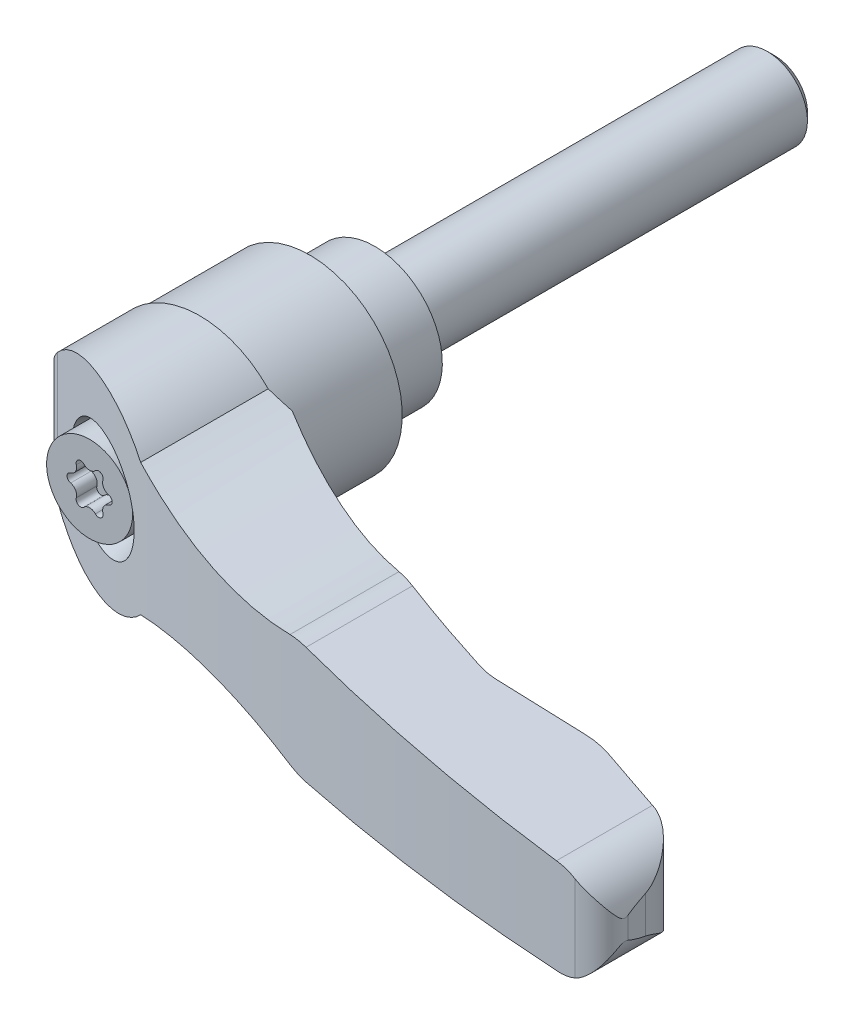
ISO-10303-21;
HEADER;
FILE_DESCRIPTION(('STEP AP214'),'2;1');
FILE_NAME('part.step','',(''),(''),'','','');
FILE_SCHEMA(('AUTOMOTIVE_DESIGN { 1 0 10303 214 1 1 1 1 }'));
ENDSEC;
DATA;
#1=APPLICATION_CONTEXT('core data for automotive mechanical design processes');
#2=APPLICATION_PROTOCOL_DEFINITION('international standard','automotive_design',2000,#1);
#3=PRODUCT_CONTEXT('',#1,'mechanical');
#4=PRODUCT('Part','Part','',(#3));
#5=PRODUCT_RELATED_PRODUCT_CATEGORY('part','',(#4));
#6=PRODUCT_DEFINITION_FORMATION('','',#4);
#7=PRODUCT_DEFINITION_CONTEXT('part definition',#1,'design');
#8=PRODUCT_DEFINITION('design','',#6,#7);
#9=PRODUCT_DEFINITION_SHAPE('','',#8);
#10=(LENGTH_UNIT() NAMED_UNIT(*) SI_UNIT(.MILLI.,.METRE.));
#11=(NAMED_UNIT(*) PLANE_ANGLE_UNIT() SI_UNIT($,.RADIAN.));
#12=(NAMED_UNIT(*) SI_UNIT($,.STERADIAN.) SOLID_ANGLE_UNIT());
#13=UNCERTAINTY_MEASURE_WITH_UNIT(LENGTH_MEASURE(1.E-05),#10,'distance_accuracy_value','');
#14=(GEOMETRIC_REPRESENTATION_CONTEXT(3) GLOBAL_UNCERTAINTY_ASSIGNED_CONTEXT((#13)) GLOBAL_UNIT_ASSIGNED_CONTEXT((#10,
#11,#12)) REPRESENTATION_CONTEXT('',''));
#15=CARTESIAN_POINT('',(0.,0.,0.));
#16=DIRECTION('',(0.,0.,1.));
#17=DIRECTION('',(1.,0.,0.));
#18=AXIS2_PLACEMENT_3D('',#15,#16,#17);
#19=CARTESIAN_POINT('',(0.,0.,-7.116040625));
#20=DIRECTION('',(0.,0.,-1.));
#21=DIRECTION('',(0.,1.,0.));
#22=AXIS2_PLACEMENT_3D('',#19,#20,#21);
#23=CYLINDRICAL_SURFACE('',#22,4.);
#24=CARTESIAN_POINT('',(0.,0.,-39.23));
#25=DIRECTION('',(0.,0.,-1.));
#26=DIRECTION('',(0.,1.,0.));
#27=AXIS2_PLACEMENT_3D('',#24,#25,#26);
#28=CIRCLE('',#27,4.);
#29=CARTESIAN_POINT('',(0.,4.,-39.23));
#30=VERTEX_POINT('',#29);
#31=EDGE_CURVE('E9',#30,#30,#28,.F.);
#32=ORIENTED_EDGE('',*,*,#31,.T.);
#33=EDGE_LOOP('',(#32));
#34=FACE_BOUND('',#33,.T.);
#35=CARTESIAN_POINT('',(0.,0.,0.));
#36=DIRECTION('',(0.,0.,-1.));
#37=DIRECTION('',(0.,1.,0.));
#38=AXIS2_PLACEMENT_3D('',#35,#36,#37);
#39=CIRCLE('',#38,4.);
#40=CARTESIAN_POINT('',(0.,4.,0.));
#41=VERTEX_POINT('',#40);
#42=EDGE_CURVE('E547',#41,#41,#39,.F.);
#43=ORIENTED_EDGE('',*,*,#42,.F.);
#44=EDGE_LOOP('',(#43));
#45=FACE_BOUND('',#44,.T.);
#46=ADVANCED_FACE('F14',(#34,#45),#23,.T.);
#47=CARTESIAN_POINT('',(5.375,0.,0.));
#48=DIRECTION('',(0.,0.,-1.));
#49=DIRECTION('',(0.,1.,0.));
#50=AXIS2_PLACEMENT_3D('',#47,#48,#49);
#51=PLANE('',#50);
#52=ORIENTED_EDGE('',*,*,#42,.T.);
#53=EDGE_LOOP('',(#52));
#54=FACE_BOUND('',#53,.T.);
#55=CARTESIAN_POINT('',(0.,0.,0.));
#56=DIRECTION('',(0.,0.,-1.));
#57=DIRECTION('',(0.,1.,0.));
#58=AXIS2_PLACEMENT_3D('',#55,#56,#57);
#59=CIRCLE('',#58,6.75);
#60=CARTESIAN_POINT('',(0.,6.75,0.));
#61=VERTEX_POINT('',#60);
#62=EDGE_CURVE('E732',#61,#61,#59,.F.);
#63=ORIENTED_EDGE('',*,*,#62,.F.);
#64=EDGE_LOOP('',(#63));
#65=FACE_BOUND('',#64,.T.);
#66=ADVANCED_FACE('F817',(#54,#65),#51,.T.);
#67=CARTESIAN_POINT('',(0.,0.,8.25));
#68=DIRECTION('',(0.,0.,-1.));
#69=DIRECTION('',(0.,1.,0.));
#70=AXIS2_PLACEMENT_3D('',#67,#68,#69);
#71=CYLINDRICAL_SURFACE('',#70,6.75);
#72=ORIENTED_EDGE('',*,*,#62,.T.);
#73=EDGE_LOOP('',(#72));
#74=FACE_BOUND('',#73,.T.);
#75=CARTESIAN_POINT('',(0.,0.,7.15000000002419));
#76=DIRECTION('',(0.,0.,-1.));
#77=DIRECTION('',(1.,0.,0.));
#78=AXIS2_PLACEMENT_3D('',#75,#76,#77);
#79=CIRCLE('',#78,6.74999999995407);
#80=CARTESIAN_POINT('',(6.74999999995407,0.,7.15000000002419));
#81=VERTEX_POINT('',#80);
#82=EDGE_CURVE('E540',#81,#81,#79,.T.);
#83=ORIENTED_EDGE('',*,*,#82,.T.);
#84=EDGE_LOOP('',(#83));
#85=FACE_BOUND('',#84,.T.);
#86=ADVANCED_FACE('F824',(#74,#85),#71,.T.);
#87=CARTESIAN_POINT('',(0.,0.,6.9000000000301));
#88=DIRECTION('',(0.,0.,-1.));
#89=DIRECTION('',(0.,1.,0.));
#90=AXIS2_PLACEMENT_3D('',#87,#88,#89);
#91=CONICAL_SURFACE('',#90,7.000000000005,0.785398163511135);
#92=ORIENTED_EDGE('',*,*,#82,.F.);
#93=EDGE_LOOP('',(#92));
#94=FACE_BOUND('',#93,.T.);
#95=CARTESIAN_POINT('',(0.,0.,6.9));
#96=DIRECTION('',(0.,0.,-1.));
#97=DIRECTION('',(0.,1.,0.));
#98=AXIS2_PLACEMENT_3D('',#95,#96,#97);
#99=CIRCLE('',#98,7.);
#100=CARTESIAN_POINT('',(0.,7.,6.9));
#101=VERTEX_POINT('',#100);
#102=EDGE_CURVE('E536',#101,#101,#99,.T.);
#103=ORIENTED_EDGE('',*,*,#102,.T.);
#104=EDGE_LOOP('',(#103));
#105=FACE_BOUND('',#104,.T.);
#106=ADVANCED_FACE('F832',(#94,#105),#91,.F.);
#107=CARTESIAN_POINT('',(0.,0.,6.2));
#108=DIRECTION('',(0.,0.,-1.));
#109=DIRECTION('',(0.,1.,0.));
#110=AXIS2_PLACEMENT_3D('',#107,#108,#109);
#111=CYLINDRICAL_SURFACE('',#110,7.);
#112=ORIENTED_EDGE('',*,*,#102,.F.);
#113=EDGE_LOOP('',(#112));
#114=FACE_BOUND('',#113,.T.);
#115=CARTESIAN_POINT('',(0.,0.,6.5));
#116=DIRECTION('',(0.,0.,-1.));
#117=DIRECTION('',(0.,1.,0.));
#118=AXIS2_PLACEMENT_3D('',#115,#116,#117);
#119=CIRCLE('',#118,7.);
#120=CARTESIAN_POINT('',(0.,7.,6.5));
#121=VERTEX_POINT('',#120);
#122=EDGE_CURVE('E539',#121,#121,#119,.F.);
#123=ORIENTED_EDGE('',*,*,#122,.F.);
#124=EDGE_LOOP('',(#123));
#125=FACE_BOUND('',#124,.T.);
#126=ADVANCED_FACE('F839',(#114,#125),#111,.F.);
#127=CARTESIAN_POINT('',(-9.01003775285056,-19.,6.5));
#128=DIRECTION('',(0.707106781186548,0.,0.707106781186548));
#129=DIRECTION('',(-0.707106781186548,0.,0.707106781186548));
#130=AXIS2_PLACEMENT_3D('',#127,#128,#129);
#131=PLANE('',#130);
#132=DIRECTION('',(0.,1.,0.));
#133=VECTOR('',#132,1.);
#134=CARTESIAN_POINT('',(-9.01003775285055,0.,6.5));
#135=LINE('',#134,#133);
#136=CARTESIAN_POINT('',(-9.01003775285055,-2.13584185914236,6.5));
#137=VERTEX_POINT('',#136);
#138=CARTESIAN_POINT('',(-9.01003775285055,2.13584185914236,6.5));
#139=VERTEX_POINT('',#138);
#140=EDGE_CURVE('E727',#137,#139,#135,.T.);
#141=ORIENTED_EDGE('',*,*,#140,.F.);
#142=CARTESIAN_POINT('',(-0.00999999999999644,0.,-2.50003775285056));
#143=DIRECTION('',(0.707106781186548,0.,0.707106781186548));
#144=DIRECTION('',(-0.707106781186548,0.,0.707106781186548));
#145=AXIS2_PLACEMENT_3D('',#142,#143,#144);
#146=ELLIPSE('',#145,13.0814754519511,9.25);
#147=EDGE_CURVE('E724',#139,#137,#146,.T.);
#148=ORIENTED_EDGE('',*,*,#147,.F.);
#149=EDGE_LOOP('',(#141,#148));
#150=FACE_BOUND('',#149,.T.);
#151=ADVANCED_FACE('F843',(#150),#131,.F.);
#152=CARTESIAN_POINT('',(-4.635,0.,6.5));
#153=DIRECTION('',(0.,0.,-1.));
#154=DIRECTION('',(0.,1.,0.));
#155=AXIS2_PLACEMENT_3D('',#152,#153,#154);
#156=PLANE('',#155);
#157=ORIENTED_EDGE('',*,*,#140,.T.);
#158=CARTESIAN_POINT('',(-0.00999999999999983,0.,6.5));
#159=DIRECTION('',(0.,0.,1.));
#160=DIRECTION('',(-1.,0.,0.));
#161=AXIS2_PLACEMENT_3D('',#158,#159,#160);
#162=CIRCLE('',#161,9.25);
#163=EDGE_CURVE('E720',#137,#139,#162,.T.);
#164=ORIENTED_EDGE('',*,*,#163,.F.);
#165=EDGE_LOOP('',(#157,#164));
#166=FACE_BOUND('',#165,.T.);
#167=ORIENTED_EDGE('',*,*,#122,.T.);
#168=EDGE_LOOP('',(#167));
#169=FACE_BOUND('',#168,.T.);
#170=ADVANCED_FACE('F847',(#166,#169),#156,.T.);
#171=CARTESIAN_POINT('',(-0.0100000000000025,0.,13.5625));
#172=DIRECTION('',(0.,0.,1.));
#173=DIRECTION('',(-1.,0.,0.));
#174=AXIS2_PLACEMENT_3D('',#171,#172,#173);
#175=CYLINDRICAL_SURFACE('',#174,9.25);
#176=ORIENTED_EDGE('',*,*,#163,.T.);
#177=ORIENTED_EDGE('',*,*,#147,.T.);
#178=EDGE_LOOP('',(#176,#177));
#179=FACE_BOUND('',#178,.T.);
#180=CARTESIAN_POINT('',(-0.010000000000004,0.,17.5));
#181=DIRECTION('',(0.,0.,1.));
#182=DIRECTION('',(-1.,0.,0.));
#183=AXIS2_PLACEMENT_3D('',#180,#181,#182);
#184=CIRCLE('',#183,9.25);
#185=CARTESIAN_POINT('',(-9.26,0.,17.5));
#186=VERTEX_POINT('',#185);
#187=CARTESIAN_POINT('',(9.23999999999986,0.,17.5000000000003));
#188=VERTEX_POINT('',#187);
#189=EDGE_CURVE('E710',#186,#188,#184,.T.);
#190=ORIENTED_EDGE('',*,*,#189,.F.);
#191=CARTESIAN_POINT('',(-0.010000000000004,0.,17.5));
#192=DIRECTION('',(0.,0.,1.));
#193=DIRECTION('',(-1.,0.,0.));
#194=AXIS2_PLACEMENT_3D('',#191,#192,#193);
#195=CIRCLE('',#194,9.25);
#196=EDGE_CURVE('E531',#188,#186,#195,.T.);
#197=ORIENTED_EDGE('',*,*,#196,.F.);
#198=EDGE_LOOP('',(#190,#197));
#199=FACE_BOUND('',#198,.T.);
#200=ADVANCED_FACE('F717',(#179,#199),#175,.T.);
#201=CARTESIAN_POINT('',(64.6274051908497,-10.5,37.5817950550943));
#202=DIRECTION('',(0.992331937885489,0.,-0.123601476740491));
#203=DIRECTION('',(0.123601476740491,0.,0.992331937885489));
#204=AXIS2_PLACEMENT_3D('',#201,#202,#203);
#205=PLANE('',#204);
#206=CARTESIAN_POINT('',(60.25,0.,2.43788666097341));
#207=DIRECTION('',(0.992331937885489,0.,-0.123601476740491));
#208=DIRECTION('',(0.123601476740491,0.,0.992331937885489));
#209=AXIS2_PLACEMENT_3D('',#206,#207,#208);
#210=ELLIPSE('',#209,38.4299615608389,4.75);
#211=CARTESIAN_POINT('',(64.8745408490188,1.08449155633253,39.5659186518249));
#212=VERTEX_POINT('',#211);
#213=CARTESIAN_POINT('',(64.6274051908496,1.84413226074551,37.5817950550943));
#214=VERTEX_POINT('',#213);
#215=EDGE_CURVE('E421',#212,#214,#210,.F.);
#216=ORIENTED_EDGE('',*,*,#215,.F.);
#217=DIRECTION('',(0.,-1.,0.));
#218=VECTOR('',#217,1.);
#219=CARTESIAN_POINT('',(64.8745408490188,-10.5,39.5659186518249));
#220=LINE('',#219,#218);
#221=CARTESIAN_POINT('',(64.8745408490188,-1.08449155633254,39.5659186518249));
#222=VERTEX_POINT('',#221);
#223=EDGE_CURVE('E460',#222,#212,#220,.F.);
#224=ORIENTED_EDGE('',*,*,#223,.F.);
#225=CARTESIAN_POINT('',(60.25,0.,2.43788666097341));
#226=DIRECTION('',(0.992331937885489,0.,-0.123601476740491));
#227=DIRECTION('',(0.123601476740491,0.,0.992331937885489));
#228=AXIS2_PLACEMENT_3D('',#225,#226,#227);
#229=ELLIPSE('',#228,38.4299615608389,4.75);
#230=CARTESIAN_POINT('',(64.6274051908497,-1.84413226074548,37.5817950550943));
#231=VERTEX_POINT('',#230);
#232=EDGE_CURVE('E444',#231,#222,#229,.F.);
#233=ORIENTED_EDGE('',*,*,#232,.F.);
#234=DIRECTION('',(0.,-1.,0.));
#235=VECTOR('',#234,1.);
#236=CARTESIAN_POINT('',(64.6274051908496,-10.5,37.5817950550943));
#237=LINE('',#236,#235);
#238=EDGE_CURVE('E718',#214,#231,#237,.T.);
#239=ORIENTED_EDGE('',*,*,#238,.F.);
#240=EDGE_LOOP('',(#216,#224,#233,#239));
#241=FACE_BOUND('',#240,.T.);
#242=ADVANCED_FACE('F430',(#241),#205,.T.);
#243=CARTESIAN_POINT('',(58.6337202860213,-10.5,38.3283479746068));
#244=DIRECTION('',(0.,-1.,0.));
#245=DIRECTION('',(1.,0.,0.));
#246=AXIS2_PLACEMENT_3D('',#243,#244,#245);
#247=CYLINDRICAL_SURFACE('',#246,6.04);
#248=CARTESIAN_POINT('',(64.6274051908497,1.84413226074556,37.5817950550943));
#249=CARTESIAN_POINT('',(64.6175868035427,1.86745330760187,37.5030045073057));
#250=CARTESIAN_POINT('',(64.6063375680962,1.89362327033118,37.4253204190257));
#251=CARTESIAN_POINT('',(64.5811702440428,1.95049016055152,37.2721928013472));
#252=CARTESIAN_POINT('',(64.5672561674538,1.98118026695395,37.1967460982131));
#253=CARTESIAN_POINT('',(64.5369883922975,2.04585034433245,37.0482136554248));
#254=CARTESIAN_POINT('',(64.520645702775,2.07981523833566,36.9751189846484));
#255=CARTESIAN_POINT('',(64.4855821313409,2.15032519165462,36.8307396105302));
#256=CARTESIAN_POINT('',(64.4668602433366,2.18687133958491,36.7594556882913));
#257=CARTESIAN_POINT('',(64.4072221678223,2.29938724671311,36.547961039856));
#258=CARTESIAN_POINT('',(64.3628565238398,2.37818379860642,36.410218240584));
#259=CARTESIAN_POINT('',(64.2652007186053,2.53960895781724,36.1400450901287));
#260=CARTESIAN_POINT('',(64.2118976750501,2.6222429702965,36.007622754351));
#261=CARTESIAN_POINT('',(64.077119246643,2.81672317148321,35.7040219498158));
#262=CARTESIAN_POINT('',(63.9921849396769,2.92909268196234,35.5347005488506));
#263=CARTESIAN_POINT('',(63.8063278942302,3.15216626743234,35.2039790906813));
#264=CARTESIAN_POINT('',(63.7054078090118,3.26287061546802,35.0425777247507));
#265=CARTESIAN_POINT('',(63.4870671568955,3.47959027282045,34.7278934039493));
#266=CARTESIAN_POINT('',(63.369645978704,3.58560540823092,34.5746107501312));
#267=CARTESIAN_POINT('',(63.1179209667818,3.78996521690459,34.277236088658));
#268=CARTESIAN_POINT('',(62.9836257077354,3.88831374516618,34.1331394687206));
#269=CARTESIAN_POINT('',(62.6561598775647,4.10136712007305,33.815313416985));
#270=CARTESIAN_POINT('',(62.4571888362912,4.21258905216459,33.6450495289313));
#271=CARTESIAN_POINT('',(62.1378586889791,4.36029911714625,33.4069452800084));
#272=CARTESIAN_POINT('',(62.0281124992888,4.40629516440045,33.3305585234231));
#273=CARTESIAN_POINT('',(61.8018114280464,4.49098569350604,33.1841350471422));
#274=CARTESIAN_POINT('',(61.6852609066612,4.52968478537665,33.1140943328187));
#275=CARTESIAN_POINT('',(61.4786111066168,4.58924867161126,32.9993621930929));
#276=CARTESIAN_POINT('',(61.3900115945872,4.61209493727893,32.9529824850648));
#277=CARTESIAN_POINT('',(61.2097340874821,4.65295056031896,32.8642982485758));
#278=CARTESIAN_POINT('',(61.1180570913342,4.67096147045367,32.82199241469));
#279=CARTESIAN_POINT('',(60.9313596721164,4.70183469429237,32.7415027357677));
#280=CARTESIAN_POINT('',(60.8363219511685,4.71466416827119,32.7033462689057));
#281=CARTESIAN_POINT('',(60.6438287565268,4.73463763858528,32.631712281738));
#282=CARTESIAN_POINT('',(60.5463713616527,4.74177695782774,32.5982386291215));
#283=CARTESIAN_POINT('',(60.4479724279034,4.74587261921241,32.5672639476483));
#284=B_SPLINE_CURVE_WITH_KNOTS('',3,(#248,#249,#250,#251,#252,#253,#254,#255,#256,#257,#258,
#259,#260,#261,#262,#263,#264,#265,#266,#267,#268,#269,#270,#271,#272,#273,#274,#275,#276,#277,
#278,#279,#280,#281,#282,#283),.UNSPECIFIED.,.F.,.F.,(4,2,2,2,2,2,2,2,2,2,2,2,2,2,2,2,2,4),(0.,
0.248076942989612,0.495783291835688,0.742399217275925,0.989119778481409,1.48293160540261,
1.97746142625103,2.63745339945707,3.29733594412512,3.95724294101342,4.61681594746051,
5.46693586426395,5.89075482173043,6.31430511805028,6.62183365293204,6.92926331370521,
7.23861197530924,7.54821464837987),.UNSPECIFIED.);
#285=CARTESIAN_POINT('',(60.4479724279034,4.74587261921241,32.5672639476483));
#286=VERTEX_POINT('',#285);
#287=EDGE_CURVE('E412',#214,#286,#284,.T.);
#288=ORIENTED_EDGE('',*,*,#287,.F.);
#289=ORIENTED_EDGE('',*,*,#238,.T.);
#290=CARTESIAN_POINT('',(60.4479724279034,-4.74587261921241,32.5672639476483));
#291=CARTESIAN_POINT('',(60.5755504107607,-4.74057354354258,32.6074069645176));
#292=CARTESIAN_POINT('',(60.7015088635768,-4.73014540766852,32.6517620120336));
#293=CARTESIAN_POINT('',(60.9490652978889,-4.69992242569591,32.7481786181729));
#294=CARTESIAN_POINT('',(61.0706698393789,-4.6801423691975,32.8002279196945));
#295=CARTESIAN_POINT('',(61.3074659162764,-4.63235500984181,32.9108206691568));
#296=CARTESIAN_POINT('',(61.4227141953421,-4.60444273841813,32.9692844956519));
#297=CARTESIAN_POINT('',(61.6477173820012,-4.54120548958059,33.0925213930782));
#298=CARTESIAN_POINT('',(61.7574696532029,-4.50587699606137,33.1572974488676));
#299=CARTESIAN_POINT('',(61.9940137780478,-4.42040174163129,33.307032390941));
#300=CARTESIAN_POINT('',(62.1193938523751,-4.36870213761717,33.3933358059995));
#301=CARTESIAN_POINT('',(62.3610721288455,-4.25718277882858,33.5732278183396));
#302=CARTESIAN_POINT('',(62.4773638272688,-4.19735729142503,33.6668215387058));
#303=CARTESIAN_POINT('',(62.7012840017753,-4.07066877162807,33.8608437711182));
#304=CARTESIAN_POINT('',(62.8088611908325,-4.0037687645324,33.9613071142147));
#305=CARTESIAN_POINT('',(63.0146476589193,-3.86453813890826,34.1677809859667));
#306=CARTESIAN_POINT('',(63.1128596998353,-3.79220913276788,34.2737898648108));
#307=CARTESIAN_POINT('',(63.3331746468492,-3.61700510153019,34.5290929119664));
#308=CARTESIAN_POINT('',(63.4514763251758,-3.51235864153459,34.6804594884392));
#309=CARTESIAN_POINT('',(63.6718053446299,-3.29808480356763,34.9913387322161));
#310=CARTESIAN_POINT('',(63.7738256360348,-3.18845529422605,35.1508548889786));
#311=CARTESIAN_POINT('',(63.961662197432,-2.9676568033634,35.4770445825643));
#312=CARTESIAN_POINT('',(64.0475378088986,-2.85649513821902,35.6436890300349));
#313=CARTESIAN_POINT('',(64.2038484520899,-2.63586419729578,35.9851508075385));
#314=CARTESIAN_POINT('',(64.2742871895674,-2.52639452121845,36.1599661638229));
#315=CARTESIAN_POINT('',(64.3705847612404,-2.36382517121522,36.4361542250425));
#316=CARTESIAN_POINT('',(64.4019853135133,-2.30809068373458,36.5340606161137));
#317=CARTESIAN_POINT('',(64.4601539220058,-2.20019362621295,36.7330390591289));
#318=CARTESIAN_POINT('',(64.4869269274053,-2.14802727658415,36.8341075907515));
#319=CARTESIAN_POINT('',(64.5357331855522,-2.04890785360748,37.0402846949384));
#320=CARTESIAN_POINT('',(64.5577546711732,-2.00196785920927,37.1454025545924));
#321=CARTESIAN_POINT('',(64.596614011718,-1.91618262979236,37.360168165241));
#322=CARTESIAN_POINT('',(64.6134353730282,-1.87736327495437,37.4698291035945));
#323=CARTESIAN_POINT('',(64.6274051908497,-1.84413226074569,37.5817950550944));
#324=B_SPLINE_CURVE_WITH_KNOTS('',3,(#290,#291,#292,#293,#294,#295,#296,#297,#298,#299,#300,
#301,#302,#303,#304,#305,#306,#307,#308,#309,#310,#311,#312,#313,#314,#315,#316,#317,#318,#319,
#320,#321,#322,#323),.UNSPECIFIED.,.F.,.F.,(4,2,2,2,2,2,2,2,2,2,2,2,2,2,2,2,4),(0.,
0.401264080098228,0.801895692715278,1.19802151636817,1.59433557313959,2.0758833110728,
2.55777255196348,3.04231807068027,3.52672024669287,4.18208013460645,4.83772302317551,
5.49090678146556,6.1439335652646,6.49464389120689,6.84497677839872,7.19616755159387,
7.54846105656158),.UNSPECIFIED.);
#325=CARTESIAN_POINT('',(60.4479724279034,-4.74587261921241,32.5672639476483));
#326=VERTEX_POINT('',#325);
#327=EDGE_CURVE('E436',#326,#231,#324,.T.);
#328=ORIENTED_EDGE('',*,*,#327,.F.);
#329=DIRECTION('',(0.,-1.,0.));
#330=VECTOR('',#329,1.);
#331=CARTESIAN_POINT('',(60.4479724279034,-10.5,32.5672639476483));
#332=LINE('',#331,#330);
#333=EDGE_CURVE('E526',#286,#326,#332,.T.);
#334=ORIENTED_EDGE('',*,*,#333,.F.);
#335=EDGE_LOOP('',(#288,#289,#328,#334));
#336=FACE_BOUND('',#335,.T.);
#337=ADVANCED_FACE('F424',(#336),#247,.T.);
#338=CARTESIAN_POINT('',(-9.26,-10.5,17.5));
#339=DIRECTION('',(0.,0.,-1.));
#340=DIRECTION('',(0.,1.,0.));
#341=AXIS2_PLACEMENT_3D('',#338,#339,#340);
#342=PLANE('',#341);
#343=DIRECTION('',(0.,-1.,0.));
#344=VECTOR('',#343,1.);
#345=CARTESIAN_POINT('',(-9.26,-10.5,17.5));
#346=LINE('',#345,#344);
#347=CARTESIAN_POINT('',(-9.26,2.12188595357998,17.5));
#348=VERTEX_POINT('',#347);
#349=EDGE_CURVE('E527',#348,#186,#346,.T.);
#350=ORIENTED_EDGE('',*,*,#349,.F.);
#351=CARTESIAN_POINT('',(0.,0.,17.5));
#352=DIRECTION('',(0.,0.,1.));
#353=DIRECTION('',(0.,-1.,0.));
#354=AXIS2_PLACEMENT_3D('',#351,#352,#353);
#355=CIRCLE('',#354,9.5);
#356=CARTESIAN_POINT('',(6.84374087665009,6.58887022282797,17.5));
#357=VERTEX_POINT('',#356);
#358=EDGE_CURVE('E338',#357,#348,#355,.T.);
#359=ORIENTED_EDGE('',*,*,#358,.F.);
#360=CARTESIAN_POINT('',(19.25,44.09,17.5));
#361=DIRECTION('',(0.,0.,1.));
#362=DIRECTION('',(0.,-1.,0.));
#363=AXIS2_PLACEMENT_3D('',#360,#361,#362);
#364=CIRCLE('',#363,39.5);
#365=CARTESIAN_POINT('',(9.23999999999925,5.87940068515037,17.5000000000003));
#366=VERTEX_POINT('',#365);
#367=EDGE_CURVE('E339',#357,#366,#364,.T.);
#368=ORIENTED_EDGE('',*,*,#367,.T.);
#369=DIRECTION('',(0.,-1.,0.));
#370=VECTOR('',#369,1.);
#371=CARTESIAN_POINT('',(9.23999999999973,-10.5,17.5000000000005));
#372=LINE('',#371,#370);
#373=EDGE_CURVE('E471',#366,#188,#372,.T.);
#374=ORIENTED_EDGE('',*,*,#373,.T.);
#375=ORIENTED_EDGE('',*,*,#196,.T.);
#376=EDGE_LOOP('',(#350,#359,#368,#374,#375));
#377=FACE_BOUND('',#376,.T.);
#378=ADVANCED_FACE('F429',(#377),#342,.T.);
#379=CARTESIAN_POINT('',(-9.26,-10.5,21.2038249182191));
#380=DIRECTION('',(-1.,0.,0.));
#381=DIRECTION('',(0.,-1.,0.));
#382=AXIS2_PLACEMENT_3D('',#379,#380,#381);
#383=PLANE('',#382);
#384=ORIENTED_EDGE('',*,*,#349,.T.);
#385=DIRECTION('',(0.,1.,0.));
#386=VECTOR('',#385,1.);
#387=CARTESIAN_POINT('',(-9.26,-10.5,17.5));
#388=LINE('',#387,#386);
#389=CARTESIAN_POINT('',(-9.26,-2.12188595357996,17.5));
#390=VERTEX_POINT('',#389);
#391=EDGE_CURVE('E706',#390,#186,#388,.T.);
#392=ORIENTED_EDGE('',*,*,#391,.F.);
#393=DIRECTION('',(0.,0.,1.));
#394=VECTOR('',#393,1.);
#395=CARTESIAN_POINT('',(-9.26,-2.12188595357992,42.5));
#396=LINE('',#395,#394);
#397=CARTESIAN_POINT('',(-9.26,-2.12188595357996,21.2038249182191));
#398=VERTEX_POINT('',#397);
#399=EDGE_CURVE('E530',#398,#390,#396,.F.);
#400=ORIENTED_EDGE('',*,*,#399,.F.);
#401=DIRECTION('',(0.,-1.,0.));
#402=VECTOR('',#401,1.);
#403=CARTESIAN_POINT('',(-9.26,-10.5,21.2038249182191));
#404=LINE('',#403,#402);
#405=CARTESIAN_POINT('',(-9.26,2.12188595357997,21.2038249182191));
#406=VERTEX_POINT('',#405);
#407=EDGE_CURVE('E493',#406,#398,#404,.T.);
#408=ORIENTED_EDGE('',*,*,#407,.F.);
#409=DIRECTION('',(0.,0.,1.));
#410=VECTOR('',#409,1.);
#411=CARTESIAN_POINT('',(-9.26,2.12188595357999,42.5));
#412=LINE('',#411,#410);
#413=EDGE_CURVE('E491',#348,#406,#412,.T.);
#414=ORIENTED_EDGE('',*,*,#413,.F.);
#415=EDGE_LOOP('',(#384,#392,#400,#408,#414));
#416=FACE_BOUND('',#415,.T.);
#417=ADVANCED_FACE('F708',(#416),#383,.T.);
#418=CARTESIAN_POINT('',(-9.26,-10.5,17.5));
#419=DIRECTION('',(0.,0.,-1.));
#420=DIRECTION('',(0.,1.,0.));
#421=AXIS2_PLACEMENT_3D('',#418,#419,#420);
#422=PLANE('',#421);
#423=DIRECTION('',(0.,-1.,0.));
#424=VECTOR('',#423,1.);
#425=CARTESIAN_POINT('',(9.23999999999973,-10.5,17.5000000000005));
#426=LINE('',#425,#424);
#427=CARTESIAN_POINT('',(9.23999999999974,-5.87940068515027,17.5000000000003));
#428=VERTEX_POINT('',#427);
#429=EDGE_CURVE('E639',#188,#428,#426,.T.);
#430=ORIENTED_EDGE('',*,*,#429,.T.);
#431=CARTESIAN_POINT('',(19.25,-44.09,17.5));
#432=DIRECTION('',(0.,0.,1.));
#433=DIRECTION('',(0.,-1.,0.));
#434=AXIS2_PLACEMENT_3D('',#431,#432,#433);
#435=CIRCLE('',#434,39.5);
#436=CARTESIAN_POINT('',(6.84374087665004,-6.588870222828,17.5));
#437=VERTEX_POINT('',#436);
#438=EDGE_CURVE('E305',#428,#437,#435,.T.);
#439=ORIENTED_EDGE('',*,*,#438,.T.);
#440=CARTESIAN_POINT('',(0.,0.,17.5));
#441=DIRECTION('',(0.,0.,1.));
#442=DIRECTION('',(0.,-1.,0.));
#443=AXIS2_PLACEMENT_3D('',#440,#441,#442);
#444=CIRCLE('',#443,9.5);
#445=EDGE_CURVE('E496',#390,#437,#444,.T.);
#446=ORIENTED_EDGE('',*,*,#445,.F.);
#447=ORIENTED_EDGE('',*,*,#391,.T.);
#448=ORIENTED_EDGE('',*,*,#189,.T.);
#449=EDGE_LOOP('',(#430,#439,#446,#447,#448));
#450=FACE_BOUND('',#449,.T.);
#451=ADVANCED_FACE('F701',(#450),#422,.T.);
#452=CARTESIAN_POINT('',(53.8294507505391,-10.5,30.4829917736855));
#453=DIRECTION('',(0.300372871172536,0.,-0.95382185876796));
#454=DIRECTION('',(0.95382185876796,0.,0.300372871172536));
#455=AXIS2_PLACEMENT_3D('',#452,#453,#454);
#456=PLANE('',#455);
#457=CARTESIAN_POINT('',(60.25,0.,32.5049194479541));
#458=DIRECTION('',(0.300372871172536,0.,-0.95382185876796));
#459=DIRECTION('',(0.95382185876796,0.,0.300372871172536));
#460=AXIS2_PLACEMENT_3D('',#457,#458,#459);
#461=ELLIPSE('',#460,4.97996555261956,4.75);
#462=CARTESIAN_POINT('',(60.25,4.75,32.5049194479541));
#463=VERTEX_POINT('',#462);
#464=EDGE_CURVE('E461',#286,#463,#461,.F.);
#465=ORIENTED_EDGE('',*,*,#464,.F.);
#466=ORIENTED_EDGE('',*,*,#333,.T.);
#467=CARTESIAN_POINT('',(60.25,0.,32.5049194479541));
#468=DIRECTION('',(0.300372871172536,0.,-0.95382185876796));
#469=DIRECTION('',(0.95382185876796,0.,0.300372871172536));
#470=AXIS2_PLACEMENT_3D('',#467,#468,#469);
#471=ELLIPSE('',#470,4.97996555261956,4.75);
#472=CARTESIAN_POINT('',(60.25,-4.75,32.5049194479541));
#473=VERTEX_POINT('',#472);
#474=EDGE_CURVE('E445',#473,#326,#471,.F.);
#475=ORIENTED_EDGE('',*,*,#474,.F.);
#476=DIRECTION('',(-0.953255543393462,-0.0344545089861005,-0.300194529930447));
#477=VECTOR('',#476,1.);
#478=CARTESIAN_POINT('',(60.25,-4.75,32.5049194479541));
#479=LINE('',#478,#477);
#480=CARTESIAN_POINT('',(53.8294507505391,-4.98206460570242,30.4829917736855));
#481=VERTEX_POINT('',#480);
#482=EDGE_CURVE('E508',#473,#481,#479,.T.);
#483=ORIENTED_EDGE('',*,*,#482,.T.);
#484=DIRECTION('',(0.,-1.,0.));
#485=VECTOR('',#484,1.);
#486=CARTESIAN_POINT('',(53.8294507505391,-10.5,30.4829917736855));
#487=LINE('',#486,#485);
#488=CARTESIAN_POINT('',(53.8294507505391,4.98206460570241,30.4829917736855));
#489=VERTEX_POINT('',#488);
#490=EDGE_CURVE('E523',#489,#481,#487,.T.);
#491=ORIENTED_EDGE('',*,*,#490,.F.);
#492=DIRECTION('',(0.953255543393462,-0.0344545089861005,0.300194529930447));
#493=VECTOR('',#492,1.);
#494=CARTESIAN_POINT('',(53.8294507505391,4.98206460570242,30.4829917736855));
#495=LINE('',#494,#493);
#496=EDGE_CURVE('E473',#489,#463,#495,.T.);
#497=ORIENTED_EDGE('',*,*,#496,.T.);
#498=EDGE_LOOP('',(#465,#466,#475,#483,#491,#497));
#499=FACE_BOUND('',#498,.T.);
#500=ADVANCED_FACE('F868',(#499),#456,.T.);
#501=CARTESIAN_POINT('',(51.0780352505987,-10.5,39.22));
#502=DIRECTION('',(0.,-1.,0.));
#503=DIRECTION('',(1.,0.,0.));
#504=AXIS2_PLACEMENT_3D('',#501,#502,#503);
#505=CYLINDRICAL_SURFACE('',#504,9.15999999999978);
#506=CARTESIAN_POINT('',(51.0780352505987,5.08151188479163,39.22));
#507=DIRECTION('',(-0.0361204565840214,-0.999347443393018,0.));
#508=DIRECTION('',(0.999347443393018,-0.0361204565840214,0.));
#509=AXIS2_PLACEMENT_3D('',#506,#507,#508);
#510=ELLIPSE('',#509,9.16598132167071,9.15999999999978);
#511=CARTESIAN_POINT('',(51.0780352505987,5.08151188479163,30.06));
#512=VERTEX_POINT('',#511);
#513=EDGE_CURVE('E476',#512,#489,#510,.T.);
#514=ORIENTED_EDGE('',*,*,#513,.T.);
#515=ORIENTED_EDGE('',*,*,#490,.T.);
#516=CARTESIAN_POINT('',(51.0780352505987,-5.08151188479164,39.22));
#517=DIRECTION('',(-0.0361204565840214,0.999347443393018,0.));
#518=DIRECTION('',(-0.999347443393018,-0.0361204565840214,0.));
#519=AXIS2_PLACEMENT_3D('',#516,#517,#518);
#520=ELLIPSE('',#519,9.16598132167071,9.15999999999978);
#521=CARTESIAN_POINT('',(51.0780352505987,-5.08151188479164,30.06));
#522=VERTEX_POINT('',#521);
#523=EDGE_CURVE('E303',#481,#522,#520,.T.);
#524=ORIENTED_EDGE('',*,*,#523,.T.);
#525=DIRECTION('',(0.,1.,0.));
#526=VECTOR('',#525,1.);
#527=CARTESIAN_POINT('',(51.0780352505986,-10.5,30.06));
#528=LINE('',#527,#526);
#529=EDGE_CURVE('E520',#512,#522,#528,.F.);
#530=ORIENTED_EDGE('',*,*,#529,.F.);
#531=EDGE_LOOP('',(#514,#515,#524,#530));
#532=FACE_BOUND('',#531,.T.);
#533=ADVANCED_FACE('F877',(#532),#505,.T.);
#534=CARTESIAN_POINT('',(42.239481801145,-10.5,30.06));
#535=DIRECTION('',(0.,0.,-1.));
#536=DIRECTION('',(0.,1.,0.));
#537=AXIS2_PLACEMENT_3D('',#534,#535,#536);
#538=PLANE('',#537);
#539=DIRECTION('',(0.999347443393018,-0.0361204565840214,0.));
#540=VECTOR('',#539,1.);
#541=CARTESIAN_POINT('',(30.3472861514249,5.83080496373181,30.06));
#542=LINE('',#541,#540);
#543=CARTESIAN_POINT('',(42.239481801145,5.4009729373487,30.06));
#544=VERTEX_POINT('',#543);
#545=EDGE_CURVE('E477',#544,#512,#542,.T.);
#546=ORIENTED_EDGE('',*,*,#545,.T.);
#547=ORIENTED_EDGE('',*,*,#529,.T.);
#548=DIRECTION('',(-0.999347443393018,-0.0361204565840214,0.));
#549=VECTOR('',#548,1.);
#550=CARTESIAN_POINT('',(60.25,-4.75,30.06));
#551=LINE('',#550,#549);
#552=CARTESIAN_POINT('',(42.239481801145,-5.4009729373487,30.06));
#553=VERTEX_POINT('',#552);
#554=EDGE_CURVE('E505',#522,#553,#551,.T.);
#555=ORIENTED_EDGE('',*,*,#554,.T.);
#556=DIRECTION('',(0.,-1.,0.));
#557=VECTOR('',#556,1.);
#558=CARTESIAN_POINT('',(42.239481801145,-10.5,30.06));
#559=LINE('',#558,#557);
#560=EDGE_CURVE('E518',#553,#544,#559,.F.);
#561=ORIENTED_EDGE('',*,*,#560,.T.);
#562=EDGE_LOOP('',(#546,#547,#555,#561));
#563=FACE_BOUND('',#562,.T.);
#564=ADVANCED_FACE('F880',(#563),#538,.T.);
#565=CARTESIAN_POINT('',(42.2394818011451,-10.5,23.0799999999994));
#566=DIRECTION('',(0.,-1.,0.));
#567=DIRECTION('',(1.,0.,0.));
#568=AXIS2_PLACEMENT_3D('',#565,#566,#567);
#569=CYLINDRICAL_SURFACE('',#568,6.98000000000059);
#570=DIRECTION('',(0.,-1.,0.));
#571=VECTOR('',#570,1.);
#572=CARTESIAN_POINT('',(40.3024609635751,-10.5,29.785844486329));
#573=LINE('',#572,#571);
#574=CARTESIAN_POINT('',(40.3024609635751,-5.47098470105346,29.7858444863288));
#575=VERTEX_POINT('',#574);
#576=CARTESIAN_POINT('',(40.3024609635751,5.47098470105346,29.7858444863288));
#577=VERTEX_POINT('',#576);
#578=EDGE_CURVE('E535',#575,#577,#573,.F.);
#579=ORIENTED_EDGE('',*,*,#578,.T.);
#580=CARTESIAN_POINT('',(42.2394818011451,5.40097293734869,23.0799999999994));
#581=DIRECTION('',(-0.0361204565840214,-0.999347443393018,0.));
#582=DIRECTION('',(0.999347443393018,-0.0361204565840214,0.));
#583=AXIS2_PLACEMENT_3D('',#580,#581,#582);
#584=ELLIPSE('',#583,6.98455781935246,6.98000000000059);
#585=EDGE_CURVE('E480',#577,#544,#584,.F.);
#586=ORIENTED_EDGE('',*,*,#585,.T.);
#587=ORIENTED_EDGE('',*,*,#560,.F.);
#588=CARTESIAN_POINT('',(42.2394818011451,-5.4009729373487,23.0799999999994));
#589=DIRECTION('',(-0.0361204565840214,0.999347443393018,0.));
#590=DIRECTION('',(-0.999347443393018,-0.0361204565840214,0.));
#591=AXIS2_PLACEMENT_3D('',#588,#589,#590);
#592=ELLIPSE('',#591,6.98455781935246,6.98000000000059);
#593=EDGE_CURVE('E507',#553,#575,#592,.F.);
#594=ORIENTED_EDGE('',*,*,#593,.T.);
#595=EDGE_LOOP('',(#579,#586,#587,#594));
#596=FACE_BOUND('',#595,.T.);
#597=ADVANCED_FACE('F313',(#596),#569,.F.);
#598=CARTESIAN_POINT('',(88.9416647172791,-10.5,-138.600024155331));
#599=DIRECTION('',(0.,-1.,0.));
#600=DIRECTION('',(1.,0.,0.));
#601=AXIS2_PLACEMENT_3D('',#598,#599,#600);
#602=CYLINDRICAL_SURFACE('',#601,175.27);
#603=CARTESIAN_POINT('',(30.3472861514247,5.83080496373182,26.5855433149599));
#604=CARTESIAN_POINT('',(30.1696679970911,5.83722947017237,26.5225405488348));
#605=CARTESIAN_POINT('',(29.9919650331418,5.83772087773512,26.45918181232));
#606=CARTESIAN_POINT('',(29.6377732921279,5.82691956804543,26.3322542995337));
#607=CARTESIAN_POINT('',(29.461282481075,5.81567269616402,26.2686872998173));
#608=CARTESIAN_POINT('',(29.1095062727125,5.78152581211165,26.1413510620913));
#609=CARTESIAN_POINT('',(28.9342208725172,5.75862582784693,26.0775818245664));
#610=CARTESIAN_POINT('',(28.5848474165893,5.70116062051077,25.9498538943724));
#611=CARTESIAN_POINT('',(28.4107667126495,5.6665501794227,25.8858954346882));
#612=CARTESIAN_POINT('',(28.2379732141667,5.62616845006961,25.8220994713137));
#613=B_SPLINE_CURVE_WITH_KNOTS('',3,(#603,#604,#605,#606,#607,#608,#609,#610,#611,#612),
.UNSPECIFIED.,.F.,.F.,(4,2,2,2,4),(0.,0.565613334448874,1.1290258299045,1.69243697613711,
2.2580489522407),.UNSPECIFIED.);
#614=CARTESIAN_POINT('',(30.3472861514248,5.83080496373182,26.5855433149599));
#615=VERTEX_POINT('',#614);
#616=CARTESIAN_POINT('',(28.2379732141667,5.62616845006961,25.8220994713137));
#617=VERTEX_POINT('',#616);
#618=EDGE_CURVE('E475',#615,#617,#613,.T.);
#619=ORIENTED_EDGE('',*,*,#618,.F.);
#620=CARTESIAN_POINT('',(88.9416647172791,3.71296724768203,-138.600024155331));
#621=DIRECTION('',(-0.0361204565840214,-0.999347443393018,0.));
#622=DIRECTION('',(0.999347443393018,-0.0361204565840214,0.));
#623=AXIS2_PLACEMENT_3D('',#620,#621,#622);
#624=ELLIPSE('',#623,175.384448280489,175.27);
#625=EDGE_CURVE('E422',#615,#577,#624,.F.);
#626=ORIENTED_EDGE('',*,*,#625,.T.);
#627=ORIENTED_EDGE('',*,*,#578,.F.);
#628=CARTESIAN_POINT('',(88.9416647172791,-3.71296724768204,-138.600024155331));
#629=DIRECTION('',(-0.0361204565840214,0.999347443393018,0.));
#630=DIRECTION('',(-0.999347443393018,-0.0361204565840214,0.));
#631=AXIS2_PLACEMENT_3D('',#628,#629,#630);
#632=ELLIPSE('',#631,175.384448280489,175.27);
#633=CARTESIAN_POINT('',(30.3472861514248,-5.83080496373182,26.5855433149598));
#634=VERTEX_POINT('',#633);
#635=EDGE_CURVE('E504',#575,#634,#632,.F.);
#636=ORIENTED_EDGE('',*,*,#635,.T.);
#637=CARTESIAN_POINT('',(28.237973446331,-5.6261685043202,25.8220995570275));
#638=CARTESIAN_POINT('',(28.4107669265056,-5.66655022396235,25.8858955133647));
#639=CARTESIAN_POINT('',(28.584847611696,-5.70116065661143,25.9498539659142));
#640=CARTESIAN_POINT('',(28.9342210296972,-5.75862584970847,26.0775818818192));
#641=CARTESIAN_POINT('',(29.1095064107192,-5.78152582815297,26.1413511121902));
#642=CARTESIAN_POINT('',(29.461282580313,-5.81567270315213,26.2686873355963));
#643=CARTESIAN_POINT('',(29.6377733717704,-5.82691957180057,26.3322543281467));
#644=CARTESIAN_POINT('',(29.9919650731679,-5.83772087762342,26.4591818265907));
#645=CARTESIAN_POINT('',(30.169668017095,-5.83722946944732,26.5225405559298));
#646=CARTESIAN_POINT('',(30.3472861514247,-5.83080496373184,26.5855433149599));
#647=B_SPLINE_CURVE_WITH_KNOTS('',3,(#637,#638,#639,#640,#641,#642,#643,#644,#645,#646),
.UNSPECIFIED.,.F.,.F.,(4,2,2,2,4),(0.,0.565611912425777,1.12902299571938,1.69243542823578,
2.25804869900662),.UNSPECIFIED.);
#648=CARTESIAN_POINT('',(28.237973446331,-5.6261685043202,25.8220995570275));
#649=VERTEX_POINT('',#648);
#650=EDGE_CURVE('E293',#649,#634,#647,.T.);
#651=ORIENTED_EDGE('',*,*,#650,.F.);
#652=CARTESIAN_POINT('',(28.237973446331,-5.6261685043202,25.8220995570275));
#653=CARTESIAN_POINT('',(27.6467124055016,-5.48799745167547,25.6038196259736));
#654=CARTESIAN_POINT('',(27.0537779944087,-5.36383084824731,25.3812778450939));
#655=CARTESIAN_POINT('',(25.8659006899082,-5.14331117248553,24.9280288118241));
#656=CARTESIAN_POINT('',(25.2709579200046,-5.04695642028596,24.6973220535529));
#657=CARTESIAN_POINT('',(24.0803912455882,-4.88185687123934,24.2280988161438));
#658=CARTESIAN_POINT('',(23.4847674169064,-4.81310925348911,23.9895831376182));
#659=CARTESIAN_POINT('',(22.2940534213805,-4.70292970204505,23.5051335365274));
#660=CARTESIAN_POINT('',(21.6989632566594,-4.66149787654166,23.2591995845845));
#661=CARTESIAN_POINT('',(19.93823636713,-4.57874286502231,22.520112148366));
#662=CARTESIAN_POINT('',(18.7748149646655,-4.57591682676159,22.0168726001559));
#663=CARTESIAN_POINT('',(16.4631439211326,-4.67145944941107,20.9870607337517));
#664=CARTESIAN_POINT('',(15.3148886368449,-4.76978933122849,20.4604974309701));
#665=CARTESIAN_POINT('',(13.7610005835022,-4.97097993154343,19.7276539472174));
#666=CARTESIAN_POINT('',(13.3455946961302,-5.03153416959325,19.5297267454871));
#667=CARTESIAN_POINT('',(12.518128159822,-5.16561835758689,19.1314774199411));
#668=CARTESIAN_POINT('',(12.1060667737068,-5.23914536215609,18.9311558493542));
#669=CARTESIAN_POINT('',(11.282699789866,-5.39957122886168,18.526898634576));
#670=CARTESIAN_POINT('',(10.8714191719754,-5.48655913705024,18.3229475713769));
#671=CARTESIAN_POINT('',(10.0527171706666,-5.67338492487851,17.9129677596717));
#672=CARTESIAN_POINT('',(9.64529662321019,-5.77322552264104,17.7069385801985));
#673=CARTESIAN_POINT('',(9.23999999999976,-5.87940068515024,17.5000000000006));
#674=B_SPLINE_CURVE_WITH_KNOTS('',3,(#652,#653,#654,#655,#656,#657,#658,#659,#660,#661,#662,
#663,#664,#665,#666,#667,#668,#669,#670,#671,#672,#673),.UNSPECIFIED.,.F.,.F.,(4,2,2,2,2,2,2,2,
2,2,4),(0.,1.93549726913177,3.87087760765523,5.80606013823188,7.74125033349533,11.5393004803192,
15.3358951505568,16.7281050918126,18.1199993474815,19.5215293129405,20.9233561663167),.UNSPECIFIED.);
#675=EDGE_CURVE('E320',#649,#428,#674,.T.);
#676=ORIENTED_EDGE('',*,*,#675,.T.);
#677=ORIENTED_EDGE('',*,*,#429,.F.);
#678=ORIENTED_EDGE('',*,*,#373,.F.);
#679=CARTESIAN_POINT('',(9.23999999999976,5.87940068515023,17.5000000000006));
#680=CARTESIAN_POINT('',(9.79948003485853,5.73283344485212,17.7856672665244));
#681=CARTESIAN_POINT('',(10.363016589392,5.598336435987,18.0695987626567));
#682=CARTESIAN_POINT('',(11.4974282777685,5.35391463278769,18.6334448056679));
#683=CARTESIAN_POINT('',(12.068303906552,5.24399150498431,18.9133590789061));
#684=CARTESIAN_POINT('',(13.2171050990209,5.04907387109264,19.4688580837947));
#685=CARTESIAN_POINT('',(13.795037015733,4.9641038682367,19.7444383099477));
#686=CARTESIAN_POINT('',(14.9564491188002,4.81968144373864,20.2904183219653));
#687=CARTESIAN_POINT('',(15.5399291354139,4.7602282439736,20.5608182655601));
#688=CARTESIAN_POINT('',(17.2745449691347,4.62260622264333,21.3530632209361));
#689=CARTESIAN_POINT('',(18.4324989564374,4.58133087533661,21.8669029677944));
#690=CARTESIAN_POINT('',(20.7578250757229,4.60168529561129,22.8686662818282));
#691=CARTESIAN_POINT('',(21.9251896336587,4.66323920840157,23.3566086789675));
#692=CARTESIAN_POINT('',(23.5210667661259,4.81923174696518,24.0035807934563));
#693=CARTESIAN_POINT('',(23.9492706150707,4.86815261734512,24.1752006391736));
#694=CARTESIAN_POINT('',(24.8053597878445,4.98022825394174,24.5144113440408));
#695=CARTESIAN_POINT('',(25.2332451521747,5.04338070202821,24.6820028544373));
#696=CARTESIAN_POINT('',(26.0913485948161,5.18451987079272,25.01422907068));
#697=CARTESIAN_POINT('',(26.5215612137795,5.26261039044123,25.1788336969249));
#698=CARTESIAN_POINT('',(27.3808010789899,5.43340909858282,25.5037362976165));
#699=CARTESIAN_POINT('',(27.8098280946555,5.52611995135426,25.6640334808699));
#700=CARTESIAN_POINT('',(28.2379732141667,5.6261684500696,25.8220994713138));
#701=B_SPLINE_CURVE_WITH_KNOTS('',3,(#679,#680,#681,#682,#683,#684,#685,#686,#687,#688,#689,
#690,#691,#692,#693,#694,#695,#696,#697,#698,#699,#700),.UNSPECIFIED.,.F.,.F.,(4,2,2,2,2,2,2,2,
2,2,4),(0.,1.93506781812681,3.87026682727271,5.80735983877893,7.74439377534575,11.5423680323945,
15.3375418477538,16.7290777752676,18.1203872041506,19.5217406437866,20.9233497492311),.UNSPECIFIED.);
#702=EDGE_CURVE('E329',#366,#617,#701,.T.);
#703=ORIENTED_EDGE('',*,*,#702,.T.);
#704=EDGE_LOOP('',(#619,#626,#627,#636,#651,#676,#677,#678,#703));
#705=FACE_BOUND('',#704,.T.);
#706=ADVANCED_FACE('F307',(#705),#602,.F.);
#707=CARTESIAN_POINT('',(0.,0.,29.9003216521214));
#708=DIRECTION('',(0.,0.,1.));
#709=DIRECTION('',(0.,-1.,0.));
#710=AXIS2_PLACEMENT_3D('',#707,#708,#709);
#711=CONICAL_SURFACE('',#710,5.82875174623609,0.296705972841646);
#712=CARTESIAN_POINT('',(0.,0.,24.9000000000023));
#713=DIRECTION('',(0.,0.,1.));
#714=DIRECTION('',(1.,0.,0.));
#715=AXIS2_PLACEMENT_3D('',#712,#713,#714);
#716=CIRCLE('',#715,4.30000000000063);
#717=CARTESIAN_POINT('',(4.30000000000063,0.,24.9000000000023));
#718=VERTEX_POINT('',#717);
#719=EDGE_CURVE('E532',#718,#718,#716,.T.);
#720=ORIENTED_EDGE('',*,*,#719,.F.);
#721=EDGE_LOOP('',(#720));
#722=FACE_BOUND('',#721,.T.);
#723=CARTESIAN_POINT('',(-4.56439710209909,0.,25.764803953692));
#724=CARTESIAN_POINT('',(-4.56439558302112,0.15046061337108,25.7648046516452));
#725=CARTESIAN_POINT('',(-4.55780387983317,0.300968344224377,25.7676105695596));
#726=CARTESIAN_POINT('',(-4.53151252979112,0.600704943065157,25.778797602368));
#727=CARTESIAN_POINT('',(-4.511803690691,0.749932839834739,25.7871826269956));
#728=CARTESIAN_POINT('',(-4.45948005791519,1.04600005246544,25.8094281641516));
#729=CARTESIAN_POINT('',(-4.42683996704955,1.19283409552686,25.8232994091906));
#730=CARTESIAN_POINT('',(-4.34905850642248,1.48260252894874,25.8563232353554));
#731=CARTESIAN_POINT('',(-4.30391214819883,1.62553533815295,25.8754779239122));
#732=CARTESIAN_POINT('',(-4.2071549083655,1.89124253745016,25.9164806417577));
#733=CARTESIAN_POINT('',(-4.15675286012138,2.01453727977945,25.9378210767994));
#734=CARTESIAN_POINT('',(-4.0469041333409,2.25630760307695,25.9842732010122));
#735=CARTESIAN_POINT('',(-3.98745461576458,2.37478165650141,26.0093860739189));
#736=CARTESIAN_POINT('',(-3.79643552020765,2.72165568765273,26.08996136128));
#737=CARTESIAN_POINT('',(-3.65203746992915,2.94193686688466,26.150727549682));
#738=CARTESIAN_POINT('',(-3.32475441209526,3.36766354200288,26.2879467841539));
#739=CARTESIAN_POINT('',(-3.14014345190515,3.57154526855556,26.3650970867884));
#740=CARTESIAN_POINT('',(-2.74369959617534,3.94588359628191,26.5300254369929));
#741=CARTESIAN_POINT('',(-2.5318529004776,4.11632314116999,26.6178088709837));
#742=CARTESIAN_POINT('',(-2.0691428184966,4.43295367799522,26.8085845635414));
#743=CARTESIAN_POINT('',(-1.81652089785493,4.57618035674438,26.9122300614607));
#744=CARTESIAN_POINT('',(-1.293219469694,4.81815713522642,27.1256787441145));
#745=CARTESIAN_POINT('',(-1.0225341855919,4.91689292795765,27.2354838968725));
#746=CARTESIAN_POINT('',(-0.450910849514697,5.07357378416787,27.4659503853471));
#747=CARTESIAN_POINT('',(-0.149170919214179,5.12825890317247,27.5868399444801));
#748=CARTESIAN_POINT('',(0.459309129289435,5.18400967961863,27.8289889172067));
#749=CARTESIAN_POINT('',(0.766050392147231,5.18506288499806,27.9502484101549));
#750=CARTESIAN_POINT('',(1.22780782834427,5.14586017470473,28.1315744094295));
#751=CARTESIAN_POINT('',(1.38428075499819,5.12538500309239,28.192805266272));
#752=CARTESIAN_POINT('',(1.69515750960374,5.07020178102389,28.3140441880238));
#753=CARTESIAN_POINT('',(1.84956209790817,5.03549911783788,28.3740527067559));
#754=CARTESIAN_POINT('',(2.15520709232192,4.95194242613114,28.4924426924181));
#755=CARTESIAN_POINT('',(2.30644609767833,4.90308226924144,28.5508234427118));
#756=CARTESIAN_POINT('',(2.60443768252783,4.79142163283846,28.6654780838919));
#757=CARTESIAN_POINT('',(2.75119221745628,4.72862733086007,28.7217528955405));
#758=CARTESIAN_POINT('',(3.03602928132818,4.59082015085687,28.8306333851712));
#759=CARTESIAN_POINT('',(3.17422913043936,4.51609112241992,28.8832912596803));
#760=CARTESIAN_POINT('',(3.44397641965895,4.35391144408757,28.9857693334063));
#761=CARTESIAN_POINT('',(3.57552686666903,4.26646661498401,29.0355908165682));
#762=CARTESIAN_POINT('',(3.83086269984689,4.07928895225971,29.1320238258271));
#763=CARTESIAN_POINT('',(3.95464731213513,3.97955489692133,29.1786350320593));
#764=CARTESIAN_POINT('',(4.19318564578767,3.76845043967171,29.268224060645));
#765=CARTESIAN_POINT('',(4.30794383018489,3.65708585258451,29.3112036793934));
#766=CARTESIAN_POINT('',(4.52081630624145,3.43034331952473,29.3907404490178));
#767=CARTESIAN_POINT('',(4.61951368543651,3.3155930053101,29.4275271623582));
#768=CARTESIAN_POINT('',(4.80693415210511,3.07720343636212,29.4972420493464));
#769=CARTESIAN_POINT('',(4.89566184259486,2.95356832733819,29.5301720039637));
#770=CARTESIAN_POINT('',(5.06232481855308,2.69816704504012,29.591916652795));
#771=CARTESIAN_POINT('',(5.14025511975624,2.56639715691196,29.6207294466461));
#772=CARTESIAN_POINT('',(5.28443118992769,2.29577253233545,29.6739542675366));
#773=CARTESIAN_POINT('',(5.35067809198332,2.1569184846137,29.6983667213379));
#774=CARTESIAN_POINT('',(5.4667333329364,1.8827170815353,29.7410811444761));
#775=CARTESIAN_POINT('',(5.51734437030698,1.74775549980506,29.7596824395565));
#776=CARTESIAN_POINT('',(5.60723260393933,1.4736155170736,29.792689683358));
#777=CARTESIAN_POINT('',(5.64651079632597,1.33443748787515,29.8070960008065));
#778=CARTESIAN_POINT('',(5.71324276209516,1.05327039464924,29.8315562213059));
#779=CARTESIAN_POINT('',(5.74072539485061,0.911289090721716,29.841620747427));
#780=CARTESIAN_POINT('',(5.78370029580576,0.625348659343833,29.8573531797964));
#781=CARTESIAN_POINT('',(5.79920029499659,0.481390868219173,29.8630239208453));
#782=CARTESIAN_POINT('',(5.81229956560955,0.280945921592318,29.867815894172));
#783=CARTESIAN_POINT('',(5.81504920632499,0.224798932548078,29.8688216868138));
#784=CARTESIAN_POINT('',(5.8187165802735,0.112436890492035,29.8701631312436));
#785=CARTESIAN_POINT('',(5.81963431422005,0.0562218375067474,29.8704987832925));
#786=CARTESIAN_POINT('',(5.81963303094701,-0.137942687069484,29.8704983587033));
#787=CARTESIAN_POINT('',(5.81410524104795,-0.275926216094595,29.8684767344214));
#788=CARTESIAN_POINT('',(5.79204026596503,-0.550950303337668,29.8604041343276));
#789=CARTESIAN_POINT('',(5.77549661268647,-0.68799025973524,29.8543507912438));
#790=CARTESIAN_POINT('',(5.73151396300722,-0.960350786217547,29.8382473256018));
#791=CARTESIAN_POINT('',(5.70405392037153,-1.09566751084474,29.8281894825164));
#792=CARTESIAN_POINT('',(5.63849464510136,-1.36339345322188,29.8041559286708));
#793=CARTESIAN_POINT('',(5.60039127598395,-1.49580151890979,29.7901786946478));
#794=CARTESIAN_POINT('',(5.51401595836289,-1.75642091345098,29.7584589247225));
#795=CARTESIAN_POINT('',(5.46577018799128,-1.88464208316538,29.7407260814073));
#796=CARTESIAN_POINT('',(5.35950236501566,-2.13640796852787,29.7016150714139));
#797=CARTESIAN_POINT('',(5.30147673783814,-2.25995095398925,29.680235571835));
#798=CARTESIAN_POINT('',(5.11356902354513,-2.62214269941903,29.6108945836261));
#799=CARTESIAN_POINT('',(4.96972518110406,-2.85274566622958,29.5576826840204));
#800=CARTESIAN_POINT('',(4.6451793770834,-3.29280217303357,29.4371369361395));
#801=CARTESIAN_POINT('',(4.46353373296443,-3.50145355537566,29.3694399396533));
#802=CARTESIAN_POINT('',(4.07183637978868,-3.88552138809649,29.2227564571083));
#803=CARTESIAN_POINT('',(3.86177521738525,-4.06092673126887,29.1437662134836));
#804=CARTESIAN_POINT('',(3.40619427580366,-4.38457571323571,28.9715442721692));
#805=CARTESIAN_POINT('',(3.15931163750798,-4.53059710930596,28.8777463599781));
#806=CARTESIAN_POINT('',(2.64756319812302,-4.77932358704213,28.6821521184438));
#807=CARTESIAN_POINT('',(2.38269224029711,-4.88201618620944,28.5803534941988));
#808=CARTESIAN_POINT('',(1.82437065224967,-5.04793185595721,28.3644411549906));
#809=CARTESIAN_POINT('',(1.53017932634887,-5.10817475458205,28.2499567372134));
#810=CARTESIAN_POINT('',(0.936961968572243,-5.17739306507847,28.0175645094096));
#811=CARTESIAN_POINT('',(0.637934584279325,-5.18635387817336,27.8996557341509));
#812=CARTESIAN_POINT('',(0.18497499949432,-5.16113683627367,27.7198837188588));
#813=CARTESIAN_POINT('',(0.0297709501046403,-5.14547284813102,27.6580746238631));
#814=CARTESIAN_POINT('',(-0.27872740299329,-5.10027202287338,27.5348059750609));
#815=CARTESIAN_POINT('',(-0.432022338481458,-5.07073990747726,27.4733463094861));
#816=CARTESIAN_POINT('',(-0.735714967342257,-4.99792566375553,27.3511900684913));
#817=CARTESIAN_POINT('',(-0.886111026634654,-4.95463600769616,27.290493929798));
#818=CARTESIAN_POINT('',(-1.18278833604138,-4.85452998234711,27.1703824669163));
#819=CARTESIAN_POINT('',(-1.32907121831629,-4.79771906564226,27.1109666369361));
#820=CARTESIAN_POINT('',(-1.61717072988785,-4.6705132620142,26.993592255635));
#821=CARTESIAN_POINT('',(-1.75896277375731,-4.6000549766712,26.935641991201));
#822=CARTESIAN_POINT('',(-2.03615630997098,-4.44609174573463,26.8220228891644));
#823=CARTESIAN_POINT('',(-2.17156051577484,-4.36259240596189,26.7663530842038));
#824=CARTESIAN_POINT('',(-2.43492256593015,-4.18291708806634,26.6577777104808));
#825=CARTESIAN_POINT('',(-2.56287859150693,-4.08673803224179,26.604872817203));
#826=CARTESIAN_POINT('',(-2.8100750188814,-3.88228416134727,26.5024057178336));
#827=CARTESIAN_POINT('',(-2.92931972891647,-3.77401539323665,26.4528418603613));
#828=CARTESIAN_POINT('',(-3.15245691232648,-3.55149065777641,26.3598787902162));
#829=CARTESIAN_POINT('',(-3.25681238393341,-3.43777503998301,26.3162975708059));
#830=CARTESIAN_POINT('',(-3.45554683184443,-3.20066564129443,26.2331348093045));
#831=CARTESIAN_POINT('',(-3.54993054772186,-3.07727650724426,26.1935513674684));
#832=CARTESIAN_POINT('',(-3.72779985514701,-2.82154735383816,26.1188228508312));
#833=CARTESIAN_POINT('',(-3.81128200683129,-2.68920452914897,26.0836791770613));
#834=CARTESIAN_POINT('',(-3.96634322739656,-2.41657594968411,26.0183036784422));
#835=CARTESIAN_POINT('',(-4.03792375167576,-2.27629116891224,25.9880712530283));
#836=CARTESIAN_POINT('',(-4.16298800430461,-2.00060955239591,25.9351839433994));
#837=CARTESIAN_POINT('',(-4.21747078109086,-1.86574508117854,25.9121124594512));
#838=CARTESIAN_POINT('',(-4.31504053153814,-1.59125000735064,25.8707576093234));
#839=CARTESIAN_POINT('',(-4.35812882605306,-1.45161995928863,25.8524736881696));
#840=CARTESIAN_POINT('',(-4.43231431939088,-1.16903329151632,25.8209733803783));
#841=CARTESIAN_POINT('',(-4.46344133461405,-1.02608589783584,25.8077443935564));
#842=CARTESIAN_POINT('',(-4.51346285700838,-0.737753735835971,25.7864768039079));
#843=CARTESIAN_POINT('',(-4.53236509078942,-0.592370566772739,25.7784349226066));
#844=CARTESIAN_POINT('',(-4.55149044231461,-0.372209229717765,25.7702969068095));
#845=CARTESIAN_POINT('',(-4.55632812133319,-0.297873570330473,25.7682381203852));
#846=CARTESIAN_POINT('',(-4.56278201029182,-0.14902913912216,25.7654913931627));
#847=CARTESIAN_POINT('',(-4.56439785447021,-0.0745203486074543,25.7648036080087));
#848=CARTESIAN_POINT('',(-4.56439710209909,0.,25.764803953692));
#849=B_SPLINE_CURVE_WITH_KNOTS('',3,(#723,#724,#725,#726,#727,#728,#729,#730,#731,#732,#733,
#734,#735,#736,#737,#738,#739,#740,#741,#742,#743,#744,#745,#746,#747,#748,#749,#750,#751,#752,
#753,#754,#755,#756,#757,#758,#759,#760,#761,#762,#763,#764,#765,#766,#767,#768,#769,#770,#771,
#772,#773,#774,#775,#776,#777,#778,#779,#780,#781,#782,#783,#784,#785,#786,#787,#788,#789,#790,
#791,#792,#793,#794,#795,#796,#797,#798,#799,#800,#801,#802,#803,#804,#805,#806,#807,#808,#809,
#810,#811,#812,#813,#814,#815,#816,#817,#818,#819,#820,#821,#822,#823,#824,#825,#826,#827,#828,
#829,#830,#831,#832,#833,#834,#835,#836,#837,#838,#839,#840,#841,#842,#843,#844,#845,#846,#847,
#848),.UNSPECIFIED.,.T.,.F.,(4,2,2,2,2,2,2,2,2,2,2,2,2,2,2,2,2,2,2,2,2,2,2,2,2,2,2,2,2,2,2,2,2,
2,2,2,2,2,2,2,2,2,2,2,2,2,2,2,2,2,2,2,2,2,2,2,2,2,2,2,2,2,4),(0.,0.451293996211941,
0.902904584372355,1.35540304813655,1.80808226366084,2.2123178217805,2.61668048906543,
3.42403475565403,4.27745754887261,5.1313144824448,6.05237501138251,6.97373151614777,
7.95824311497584,8.94298329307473,9.45028188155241,9.95738855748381,10.464715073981,
10.9718171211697,11.4682848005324,11.964525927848,12.4608164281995,12.9568599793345,
13.4235450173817,13.8900136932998,14.3566969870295,14.8233349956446,15.2587885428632,
15.6942038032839,16.1285476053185,16.5626109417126,16.7312543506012,16.8998976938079,
17.3136713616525,17.7276881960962,18.1425071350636,18.5574875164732,18.9714096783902,
19.3854834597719,20.2123995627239,21.0631736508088,21.9142314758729,22.8156637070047,
23.7173554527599,24.6773287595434,25.6375753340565,26.1404624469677,26.6431784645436,
27.14617002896,27.6489590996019,28.1541424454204,28.6591092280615,29.1641988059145,
29.6690368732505,30.1495346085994,30.6298029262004,31.1102224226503,31.5905831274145,
32.0318231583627,32.4730120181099,32.9130938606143,33.3528972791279,33.5763894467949,
33.7999069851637),.UNSPECIFIED.);
#850=CARTESIAN_POINT('',(-4.56439710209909,0.,25.764803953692));
#851=VERTEX_POINT('',#850);
#852=EDGE_CURVE('E503',#851,#851,#849,.T.);
#853=ORIENTED_EDGE('',*,*,#852,.F.);
#854=EDGE_LOOP('',(#853));
#855=FACE_BOUND('',#854,.T.);
#856=ADVANCED_FACE('F312',(#722,#855),#711,.F.);
#857=CARTESIAN_POINT('',(60.25,0.,42.5));
#858=DIRECTION('',(0.,0.,1.));
#859=DIRECTION('',(0.,-1.,0.));
#860=AXIS2_PLACEMENT_3D('',#857,#858,#859);
#861=CYLINDRICAL_SURFACE('',#860,4.75);
#862=ORIENTED_EDGE('',*,*,#232,.T.);
#863=CARTESIAN_POINT('',(62.2749077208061,-4.29677189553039,42.276905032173));
#864=CARTESIAN_POINT('',(62.3484429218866,-4.26213869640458,42.2829554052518));
#865=CARTESIAN_POINT('',(62.4212610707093,-4.22549552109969,42.2855470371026));
#866=CARTESIAN_POINT('',(62.564774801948,-4.14860038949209,42.2843574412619));
#867=CARTESIAN_POINT('',(62.6354735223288,-4.10835415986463,42.2805861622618));
#868=CARTESIAN_POINT('',(62.7735534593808,-4.02500028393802,42.2673020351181));
#869=CARTESIAN_POINT('',(62.8409620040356,-3.98192770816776,42.2578508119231));
#870=CARTESIAN_POINT('',(62.9729170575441,-3.89288589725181,42.2338060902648));
#871=CARTESIAN_POINT('',(63.0374621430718,-3.84691524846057,42.2192100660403));
#872=CARTESIAN_POINT('',(63.1798156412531,-3.7401232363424,42.1810015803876));
#873=CARTESIAN_POINT('',(63.2566999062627,-3.67855248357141,42.1560308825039));
#874=CARTESIAN_POINT('',(63.4051883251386,-3.55201688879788,42.099741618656));
#875=CARTESIAN_POINT('',(63.4767890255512,-3.48704987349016,42.0684189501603));
#876=CARTESIAN_POINT('',(63.684137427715,-3.2872638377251,41.9659030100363));
#877=CARTESIAN_POINT('',(63.811716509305,-3.14810402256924,41.8863686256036));
#878=CARTESIAN_POINT('',(64.0078346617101,-2.90809595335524,41.7387707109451));
#879=CARTESIAN_POINT('',(64.0822428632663,-2.80914674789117,41.675109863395));
#880=CARTESIAN_POINT('',(64.2213033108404,-2.60884800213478,41.5411877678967));
#881=CARTESIAN_POINT('',(64.2859552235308,-2.50749837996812,41.4709262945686));
#882=CARTESIAN_POINT('',(64.4056344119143,-2.30372384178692,41.3246959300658));
#883=CARTESIAN_POINT('',(64.4606832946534,-2.20130190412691,41.2487404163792));
#884=CARTESIAN_POINT('',(64.5615971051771,-1.99640423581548,41.091141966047));
#885=CARTESIAN_POINT('',(64.6074681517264,-1.89392858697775,41.0095028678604));
#886=CARTESIAN_POINT('',(64.6724899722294,-1.73436568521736,40.8759658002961));
#887=CARTESIAN_POINT('',(64.6946729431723,-1.67662827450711,40.8262975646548));
#888=CARTESIAN_POINT('',(64.7361015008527,-1.56239438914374,40.7242511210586));
#889=CARTESIAN_POINT('',(64.7553449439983,-1.50589884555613,40.6718709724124));
#890=CARTESIAN_POINT('',(64.7911041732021,-1.3944045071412,40.562612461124));
#891=CARTESIAN_POINT('',(64.807565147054,-1.33945042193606,40.5056705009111));
#892=CARTESIAN_POINT('',(64.8370703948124,-1.23458164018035,40.3864037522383));
#893=CARTESIAN_POINT('',(64.8501220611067,-1.1846561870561,40.3240910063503));
#894=CARTESIAN_POINT('',(64.8661549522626,-1.11985818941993,40.2264927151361));
#895=CARTESIAN_POINT('',(64.8707942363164,-1.10049352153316,40.1945209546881));
#896=CARTESIAN_POINT('',(64.8789586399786,-1.06562552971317,40.1283652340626));
#897=CARTESIAN_POINT('',(64.8824848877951,-1.0501182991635,40.0941835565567));
#898=CARTESIAN_POINT('',(64.8876748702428,-1.02693288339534,40.0295882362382));
#899=CARTESIAN_POINT('',(64.889552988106,-1.01837321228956,39.9995179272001));
#900=CARTESIAN_POINT('',(64.8921785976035,-1.00633880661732,39.9383655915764));
#901=CARTESIAN_POINT('',(64.8929291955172,-1.00285010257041,39.9072865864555));
#902=CARTESIAN_POINT('',(64.89321534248,-1.00152501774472,39.8449093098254));
#903=CARTESIAN_POINT('',(64.8927474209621,-1.00370478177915,39.8136106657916));
#904=CARTESIAN_POINT('',(64.8906454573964,-1.01337643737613,39.7517827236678));
#905=CARTESIAN_POINT('',(64.8890063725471,-1.02089129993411,39.7212573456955));
#906=CARTESIAN_POINT('',(64.8852969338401,-1.03758048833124,39.6696465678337));
#907=CARTESIAN_POINT('',(64.8834575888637,-1.04578030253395,39.6482116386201));
#908=CARTESIAN_POINT('',(64.8793233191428,-1.06393290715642,39.6063556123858));
#909=CARTESIAN_POINT('',(64.8770324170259,-1.07387013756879,39.5859274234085));
#910=CARTESIAN_POINT('',(64.8745408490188,-1.0844915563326,39.5659186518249));
#911=B_SPLINE_CURVE_WITH_KNOTS('',3,(#863,#864,#865,#866,#867,#868,#869,#870,#871,#872,#873,
#874,#875,#876,#877,#878,#879,#880,#881,#882,#883,#884,#885,#886,#887,#888,#889,#890,#891,#892,
#893,#894,#895,#896,#897,#898,#899,#900,#901,#902,#903,#904,#905,#906,#907,#908,#909,#910),
.UNSPECIFIED.,.F.,.F.,(4,2,2,2,2,2,2,2,2,2,2,2,2,2,2,2,2,2,2,2,2,2,2,4),(0.,0.244350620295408,
0.48831954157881,0.729688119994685,0.97117536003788,1.27556052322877,1.58014290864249,
2.19203994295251,2.60923519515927,3.02644469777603,3.4427030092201,3.85868287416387,
4.09658232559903,4.33465444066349,4.57697559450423,4.81876687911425,4.93157965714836,
5.04427771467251,5.13787391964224,5.23121179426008,5.32481580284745,5.41882529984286,
5.48780546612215,5.5561968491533),.UNSPECIFIED.);
#912=CARTESIAN_POINT('',(62.2749077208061,-4.2967718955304,42.2769050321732));
#913=VERTEX_POINT('',#912);
#914=EDGE_CURVE('E454',#913,#222,#911,.T.);
#915=ORIENTED_EDGE('',*,*,#914,.F.);
#916=CARTESIAN_POINT('',(60.25,-4.75,42.1009088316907));
#917=CARTESIAN_POINT('',(60.3850127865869,-4.75001526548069,42.1132857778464));
#918=CARTESIAN_POINT('',(60.5200387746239,-4.74424440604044,42.1255330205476));
#919=CARTESIAN_POINT('',(60.7892105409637,-4.72122523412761,42.149694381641));
#920=CARTESIAN_POINT('',(60.9233558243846,-4.70397094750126,42.1616083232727));
#921=CARTESIAN_POINT('',(61.1873029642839,-4.65849581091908,42.1848041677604));
#922=CARTESIAN_POINT('',(61.3171394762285,-4.63047940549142,42.1960936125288));
#923=CARTESIAN_POINT('',(61.5739811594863,-4.56367863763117,42.2181964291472));
#924=CARTESIAN_POINT('',(61.7009880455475,-4.52490099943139,42.2290100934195));
#925=CARTESIAN_POINT('',(61.9022195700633,-4.45411922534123,42.245968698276));
#926=CARTESIAN_POINT('',(61.977610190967,-4.42542278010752,42.2522814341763));
#927=CARTESIAN_POINT('',(62.1272657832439,-4.36405214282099,42.2647350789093));
#928=CARTESIAN_POINT('',(62.201522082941,-4.33135656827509,42.2708748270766));
#929=CARTESIAN_POINT('',(62.2749077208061,-4.29677189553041,42.2769050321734));
#930=B_SPLINE_CURVE_WITH_KNOTS('',3,(#916,#917,#918,#919,#920,#921,#922,#923,#924,#925,#926,
#927,#928,#929),.UNSPECIFIED.,.F.,.F.,(4,2,2,2,2,2,4),(0.,0.406617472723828,0.813446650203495,
1.21290179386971,1.6121078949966,1.8547546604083,2.09876071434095),.UNSPECIFIED.);
#931=CARTESIAN_POINT('',(60.25,-4.75,42.1009088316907));
#932=VERTEX_POINT('',#931);
#933=EDGE_CURVE('E387',#932,#913,#930,.T.);
#934=ORIENTED_EDGE('',*,*,#933,.F.);
#935=DIRECTION('',(0.,0.,1.));
#936=VECTOR('',#935,1.);
#937=CARTESIAN_POINT('',(60.25,-4.75,42.5));
#938=LINE('',#937,#936);
#939=EDGE_CURVE('E301',#932,#473,#938,.F.);
#940=ORIENTED_EDGE('',*,*,#939,.T.);
#941=ORIENTED_EDGE('',*,*,#474,.T.);
#942=ORIENTED_EDGE('',*,*,#327,.T.);
#943=EDGE_LOOP('',(#862,#915,#934,#940,#941,#942));
#944=FACE_BOUND('',#943,.T.);
#945=ADVANCED_FACE('F448',(#944),#861,.T.);
#946=CARTESIAN_POINT('',(62.4730975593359,-10.5,39.8650342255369));
#947=DIRECTION('',(0.,-1.,0.));
#948=DIRECTION('',(1.,0.,0.));
#949=AXIS2_PLACEMENT_3D('',#946,#947,#948);
#950=CYLINDRICAL_SURFACE('',#949,2.42);
#951=CARTESIAN_POINT('',(62.2749077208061,4.29677189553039,42.276905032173));
#952=CARTESIAN_POINT('',(62.3484429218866,4.26213869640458,42.2829554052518));
#953=CARTESIAN_POINT('',(62.4212610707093,4.22549552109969,42.2855470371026));
#954=CARTESIAN_POINT('',(62.564774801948,4.14860038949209,42.2843574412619));
#955=CARTESIAN_POINT('',(62.6354735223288,4.10835415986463,42.2805861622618));
#956=CARTESIAN_POINT('',(62.7735534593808,4.02500028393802,42.2673020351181));
#957=CARTESIAN_POINT('',(62.8409620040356,3.98192770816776,42.2578508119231));
#958=CARTESIAN_POINT('',(62.9729170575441,3.89288589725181,42.2338060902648));
#959=CARTESIAN_POINT('',(63.0374621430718,3.84691524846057,42.2192100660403));
#960=CARTESIAN_POINT('',(63.1798156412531,3.7401232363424,42.1810015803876));
#961=CARTESIAN_POINT('',(63.2566999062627,3.67855248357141,42.1560308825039));
#962=CARTESIAN_POINT('',(63.4051883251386,3.55201688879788,42.099741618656));
#963=CARTESIAN_POINT('',(63.4767890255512,3.48704987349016,42.0684189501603));
#964=CARTESIAN_POINT('',(63.684137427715,3.2872638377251,41.9659030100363));
#965=CARTESIAN_POINT('',(63.811716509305,3.14810402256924,41.8863686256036));
#966=CARTESIAN_POINT('',(64.0078346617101,2.90809595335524,41.7387707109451));
#967=CARTESIAN_POINT('',(64.0822428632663,2.80914674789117,41.675109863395));
#968=CARTESIAN_POINT('',(64.2213033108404,2.60884800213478,41.5411877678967));
#969=CARTESIAN_POINT('',(64.2859552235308,2.50749837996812,41.4709262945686));
#970=CARTESIAN_POINT('',(64.4056344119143,2.30372384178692,41.3246959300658));
#971=CARTESIAN_POINT('',(64.4606832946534,2.20130190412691,41.2487404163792));
#972=CARTESIAN_POINT('',(64.5615971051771,1.99640423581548,41.091141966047));
#973=CARTESIAN_POINT('',(64.6074681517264,1.89392858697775,41.0095028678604));
#974=CARTESIAN_POINT('',(64.6724899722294,1.73436568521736,40.8759658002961));
#975=CARTESIAN_POINT('',(64.6946729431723,1.67662827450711,40.8262975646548));
#976=CARTESIAN_POINT('',(64.7361015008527,1.56239438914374,40.7242511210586));
#977=CARTESIAN_POINT('',(64.7553449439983,1.50589884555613,40.6718709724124));
#978=CARTESIAN_POINT('',(64.7911041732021,1.3944045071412,40.562612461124));
#979=CARTESIAN_POINT('',(64.807565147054,1.33945042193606,40.5056705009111));
#980=CARTESIAN_POINT('',(64.8370703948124,1.23458164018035,40.3864037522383));
#981=CARTESIAN_POINT('',(64.8501220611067,1.1846561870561,40.3240910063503));
#982=CARTESIAN_POINT('',(64.8661549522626,1.11985818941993,40.2264927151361));
#983=CARTESIAN_POINT('',(64.8707942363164,1.10049352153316,40.1945209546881));
#984=CARTESIAN_POINT('',(64.8789586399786,1.06562552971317,40.1283652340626));
#985=CARTESIAN_POINT('',(64.8824848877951,1.0501182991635,40.0941835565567));
#986=CARTESIAN_POINT('',(64.8876748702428,1.02693288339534,40.0295882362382));
#987=CARTESIAN_POINT('',(64.889552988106,1.01837321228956,39.9995179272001));
#988=CARTESIAN_POINT('',(64.8921785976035,1.00633880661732,39.9383655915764));
#989=CARTESIAN_POINT('',(64.8929291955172,1.00285010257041,39.9072865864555));
#990=CARTESIAN_POINT('',(64.89321534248,1.00152501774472,39.8449093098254));
#991=CARTESIAN_POINT('',(64.8927474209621,1.00370478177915,39.8136106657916));
#992=CARTESIAN_POINT('',(64.8906454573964,1.01337643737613,39.7517827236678));
#993=CARTESIAN_POINT('',(64.8890063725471,1.02089129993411,39.7212573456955));
#994=CARTESIAN_POINT('',(64.8852969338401,1.03758048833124,39.6696465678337));
#995=CARTESIAN_POINT('',(64.8834575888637,1.04578030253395,39.6482116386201));
#996=CARTESIAN_POINT('',(64.8793233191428,1.06393290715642,39.6063556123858));
#997=CARTESIAN_POINT('',(64.8770324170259,1.07387013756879,39.5859274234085));
#998=CARTESIAN_POINT('',(64.8745408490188,1.0844915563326,39.5659186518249));
#999=B_SPLINE_CURVE_WITH_KNOTS('',3,(#951,#952,#953,#954,#955,#956,#957,#958,#959,#960,#961,
#962,#963,#964,#965,#966,#967,#968,#969,#970,#971,#972,#973,#974,#975,#976,#977,#978,#979,#980,
#981,#982,#983,#984,#985,#986,#987,#988,#989,#990,#991,#992,#993,#994,#995,#996,#997,#998),
.UNSPECIFIED.,.F.,.F.,(4,2,2,2,2,2,2,2,2,2,2,2,2,2,2,2,2,2,2,2,2,2,2,4),(0.,0.244350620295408,
0.48831954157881,0.729688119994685,0.97117536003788,1.27556052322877,1.58014290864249,
2.19203994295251,2.60923519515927,3.02644469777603,3.4427030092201,3.85868287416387,
4.09658232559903,4.33465444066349,4.57697559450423,4.81876687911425,4.93157965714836,
5.04427771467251,5.13787391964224,5.23121179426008,5.32481580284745,5.41882529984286,
5.48780546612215,5.5561968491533),.UNSPECIFIED.);
#1000=CARTESIAN_POINT('',(62.2749077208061,4.2967718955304,42.2769050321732));
#1001=VERTEX_POINT('',#1000);
#1002=EDGE_CURVE('E404',#1001,#212,#999,.T.);
#1003=ORIENTED_EDGE('',*,*,#1002,.F.);
#1004=DIRECTION('',(0.,-1.,0.));
#1005=VECTOR('',#1004,1.);
#1006=CARTESIAN_POINT('',(62.2749077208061,-10.5,42.2769050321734));
#1007=LINE('',#1006,#1005);
#1008=EDGE_CURVE('E386',#913,#1001,#1007,.F.);
#1009=ORIENTED_EDGE('',*,*,#1008,.F.);
#1010=ORIENTED_EDGE('',*,*,#914,.T.);
#1011=ORIENTED_EDGE('',*,*,#223,.T.);
#1012=EDGE_LOOP('',(#1003,#1009,#1010,#1011));
#1013=FACE_BOUND('',#1012,.T.);
#1014=ADVANCED_FACE('F398',(#1013),#950,.T.);
#1015=CARTESIAN_POINT('',(60.25,0.,42.5));
#1016=DIRECTION('',(0.,0.,1.));
#1017=DIRECTION('',(0.,-1.,0.));
#1018=AXIS2_PLACEMENT_3D('',#1015,#1016,#1017);
#1019=CYLINDRICAL_SURFACE('',#1018,4.75);
#1020=ORIENTED_EDGE('',*,*,#215,.T.);
#1021=ORIENTED_EDGE('',*,*,#287,.T.);
#1022=ORIENTED_EDGE('',*,*,#464,.T.);
#1023=DIRECTION('',(0.,0.,1.));
#1024=VECTOR('',#1023,1.);
#1025=CARTESIAN_POINT('',(60.25,4.75,42.5));
#1026=LINE('',#1025,#1024);
#1027=CARTESIAN_POINT('',(60.25,4.75,42.1009088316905));
#1028=VERTEX_POINT('',#1027);
#1029=EDGE_CURVE('E420',#463,#1028,#1026,.T.);
#1030=ORIENTED_EDGE('',*,*,#1029,.T.);
#1031=CARTESIAN_POINT('',(62.2749077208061,4.29677189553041,42.2769050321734));
#1032=CARTESIAN_POINT('',(62.1526074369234,4.35442457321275,42.2668563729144));
#1033=CARTESIAN_POINT('',(62.027854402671,4.40681781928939,42.2564990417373));
#1034=CARTESIAN_POINT('',(61.7743193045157,4.50079963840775,42.2352210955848));
#1035=CARTESIAN_POINT('',(61.6455353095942,4.54238294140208,42.2243002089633));
#1036=CARTESIAN_POINT('',(61.3872932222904,4.61375080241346,42.2021612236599));
#1037=CARTESIAN_POINT('',(61.2578894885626,4.6437352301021,42.1909520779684));
#1038=CARTESIAN_POINT('',(60.9971282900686,4.69274765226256,42.1681230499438));
#1039=CARTESIAN_POINT('',(60.8657720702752,4.71178234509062,42.156503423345));
#1040=CARTESIAN_POINT('',(60.6537297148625,4.73349762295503,42.1375484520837));
#1041=CARTESIAN_POINT('',(60.5733751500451,4.7396643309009,42.1303200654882));
#1042=CARTESIAN_POINT('',(60.412016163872,4.74792732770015,42.1157134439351));
#1043=CARTESIAN_POINT('',(60.3310106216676,4.75000065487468,42.1083345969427));
#1044=CARTESIAN_POINT('',(60.25,4.75,42.1009088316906));
#1045=B_SPLINE_CURVE_WITH_KNOTS('',3,(#1031,#1032,#1033,#1034,#1035,#1036,#1037,#1038,#1039,
#1040,#1041,#1042,#1043,#1044),.UNSPECIFIED.,.F.,.F.,(4,2,2,2,2,2,4),(0.,0.406619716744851,
0.813437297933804,1.21289403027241,1.61210613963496,1.8547544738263,2.09876011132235),.UNSPECIFIED.);
#1046=EDGE_CURVE('E378',#1001,#1028,#1045,.T.);
#1047=ORIENTED_EDGE('',*,*,#1046,.F.);
#1048=ORIENTED_EDGE('',*,*,#1002,.T.);
#1049=EDGE_LOOP('',(#1020,#1021,#1022,#1030,#1047,#1048));
#1050=FACE_BOUND('',#1049,.T.);
#1051=ADVANCED_FACE('F393',(#1050),#1019,.T.);
#1052=CARTESIAN_POINT('',(30.3472861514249,5.83080496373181,42.5));
#1053=DIRECTION('',(-0.0361204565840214,-0.999347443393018,0.));
#1054=DIRECTION('',(0.999347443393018,-0.0361204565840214,0.));
#1055=AXIS2_PLACEMENT_3D('',#1052,#1053,#1054);
#1056=PLANE('',#1055);
#1057=ORIENTED_EDGE('',*,*,#513,.F.);
#1058=ORIENTED_EDGE('',*,*,#545,.F.);
#1059=ORIENTED_EDGE('',*,*,#585,.F.);
#1060=ORIENTED_EDGE('',*,*,#625,.F.);
#1061=DIRECTION('',(0.,0.,1.));
#1062=VECTOR('',#1061,1.);
#1063=CARTESIAN_POINT('',(30.3472861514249,5.83080496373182,42.5));
#1064=LINE('',#1063,#1062);
#1065=CARTESIAN_POINT('',(30.3472861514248,5.83080496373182,37.2241685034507));
#1066=VERTEX_POINT('',#1065);
#1067=EDGE_CURVE('E482',#1066,#615,#1064,.F.);
#1068=ORIENTED_EDGE('',*,*,#1067,.F.);
#1069=CARTESIAN_POINT('',(79.9481999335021,4.03802742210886,-172.7981859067));
#1070=DIRECTION('',(-0.0361204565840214,-0.999347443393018,0.));
#1071=DIRECTION('',(0.999347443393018,-0.0361204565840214,0.));
#1072=AXIS2_PLACEMENT_3D('',#1069,#1070,#1071);
#1073=ELLIPSE('',#1072,215.940913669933,215.8);
#1074=EDGE_CURVE('E375',#1028,#1066,#1073,.T.);
#1075=ORIENTED_EDGE('',*,*,#1074,.F.);
#1076=ORIENTED_EDGE('',*,*,#1029,.F.);
#1077=ORIENTED_EDGE('',*,*,#496,.F.);
#1078=EDGE_LOOP('',(#1057,#1058,#1059,#1060,#1068,#1075,#1076,#1077));
#1079=FACE_BOUND('',#1078,.T.);
#1080=ADVANCED_FACE('F397',(#1079),#1056,.F.);
#1081=CARTESIAN_POINT('',(30.0583224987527,-2.16397458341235,42.5));
#1082=DIRECTION('',(0.,0.,1.));
#1083=DIRECTION('',(0.,-1.,0.));
#1084=AXIS2_PLACEMENT_3D('',#1081,#1082,#1083);
#1085=CYLINDRICAL_SURFACE('',#1084,8.);
#1086=CARTESIAN_POINT('',(30.3472861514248,5.83080496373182,37.2241685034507));
#1087=CARTESIAN_POINT('',(30.1697645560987,5.83722808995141,37.1822446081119));
#1088=CARTESIAN_POINT('',(29.9920959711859,5.83772255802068,37.1400457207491));
#1089=CARTESIAN_POINT('',(29.6379436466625,5.82692706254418,37.0554559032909));
#1090=CARTESIAN_POINT('',(29.4614580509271,5.81568603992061,37.0130664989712));
#1091=CARTESIAN_POINT('',(29.1096637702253,5.78154479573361,36.928102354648));
#1092=CARTESIAN_POINT('',(28.9343550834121,5.75864459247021,36.8855276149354));
#1093=CARTESIAN_POINT('',(28.5849091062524,5.70117409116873,36.8002038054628));
#1094=CARTESIAN_POINT('',(28.4107797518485,5.66655551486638,36.7574547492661));
#1095=CARTESIAN_POINT('',(28.2379732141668,5.62616845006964,36.714802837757));
#1096=B_SPLINE_CURVE_WITH_KNOTS('',3,(#1086,#1087,#1088,#1089,#1090,#1091,#1092,#1093,#1094,
#1095),.UNSPECIFIED.,.F.,.F.,(4,2,2,2,4),(0.,0.54745399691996,1.09263401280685,1.63781317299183,
2.18526630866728),.UNSPECIFIED.);
#1097=CARTESIAN_POINT('',(28.2379732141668,5.62616845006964,36.714802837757));
#1098=VERTEX_POINT('',#1097);
#1099=EDGE_CURVE('E364',#1066,#1098,#1096,.T.);
#1100=ORIENTED_EDGE('',*,*,#1099,.F.);
#1101=ORIENTED_EDGE('',*,*,#1067,.T.);
#1102=ORIENTED_EDGE('',*,*,#618,.T.);
#1103=DIRECTION('',(0.,0.,1.));
#1104=VECTOR('',#1103,1.);
#1105=CARTESIAN_POINT('',(28.2379732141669,5.62616845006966,42.5));
#1106=LINE('',#1105,#1104);
#1107=EDGE_CURVE('E485',#617,#1098,#1106,.T.);
#1108=ORIENTED_EDGE('',*,*,#1107,.T.);
#1109=EDGE_LOOP('',(#1100,#1101,#1102,#1108));
#1110=FACE_BOUND('',#1109,.T.);
#1111=ADVANCED_FACE('F347',(#1110),#1085,.T.);
#1112=CARTESIAN_POINT('',(19.25,44.09,42.5));
#1113=DIRECTION('',(0.,0.,1.));
#1114=DIRECTION('',(0.,-1.,0.));
#1115=AXIS2_PLACEMENT_3D('',#1112,#1113,#1114);
#1116=CYLINDRICAL_SURFACE('',#1115,39.5);
#1117=ORIENTED_EDGE('',*,*,#367,.F.);
#1118=DIRECTION('',(0.,0.,1.));
#1119=VECTOR('',#1118,1.);
#1120=CARTESIAN_POINT('',(6.84374087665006,6.58887022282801,42.5));
#1121=LINE('',#1120,#1119);
#1122=CARTESIAN_POINT('',(6.84374087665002,6.58887022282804,30.2421501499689));
#1123=VERTEX_POINT('',#1122);
#1124=EDGE_CURVE('E487',#1123,#357,#1121,.F.);
#1125=ORIENTED_EDGE('',*,*,#1124,.F.);
#1126=CARTESIAN_POINT('',(28.2379732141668,5.62616845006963,36.714802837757));
#1127=CARTESIAN_POINT('',(27.6682570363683,5.49303214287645,36.5741969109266));
#1128=CARTESIAN_POINT('',(27.096301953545,5.37273903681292,36.4305600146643));
#1129=CARTESIAN_POINT('',(25.9490941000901,5.15784722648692,36.1374174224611));
#1130=CARTESIAN_POINT('',(25.3738414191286,5.0632478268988,35.9879118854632));
#1131=CARTESIAN_POINT('',(24.2212057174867,4.89974680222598,35.6832223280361));
#1132=CARTESIAN_POINT('',(23.6438227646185,4.8308443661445,35.528038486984));
#1133=CARTESIAN_POINT('',(22.4880975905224,4.71866668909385,35.2122361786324));
#1134=CARTESIAN_POINT('',(21.9097553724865,4.67539136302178,35.0516177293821));
#1135=CARTESIAN_POINT('',(20.2001196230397,4.58518828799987,34.5690900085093));
#1136=CARTESIAN_POINT('',(19.0688077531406,4.574324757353,34.2397910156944));
#1137=CARTESIAN_POINT('',(16.8150559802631,4.64900465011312,33.5637051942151));
#1138=CARTESIAN_POINT('',(15.6926136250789,4.73452041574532,33.2169234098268));
#1139=CARTESIAN_POINT('',(13.9229387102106,4.94528995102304,32.6544330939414));
#1140=CARTESIAN_POINT('',(13.270341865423,5.03968179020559,32.4435501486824));
#1141=CARTESIAN_POINT('',(11.9722268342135,5.26066415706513,32.017276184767));
#1142=CARTESIAN_POINT('',(11.3267071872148,5.38724790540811,31.8018861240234));
#1143=CARTESIAN_POINT('',(10.0356458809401,5.67400513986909,31.3643601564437));
#1144=CARTESIAN_POINT('',(9.39021472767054,5.83459695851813,31.1421728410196));
#1145=CARTESIAN_POINT('',(8.10920891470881,6.18783091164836,30.6944696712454));
#1146=CARTESIAN_POINT('',(7.47363611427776,6.38047901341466,30.4689532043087));
#1147=CARTESIAN_POINT('',(6.84374087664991,6.58887022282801,30.2421501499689));
#1148=B_SPLINE_CURVE_WITH_KNOTS('',3,(#1126,#1127,#1128,#1129,#1130,#1131,#1132,#1133,#1134,
#1135,#1136,#1137,#1138,#1139,#1140,#1141,#1142,#1143,#1144,#1145,#1146,#1147),.UNSPECIFIED.,
.F.,.F.,(4,2,2,2,2,2,2,2,2,2,4),(0.,1.80500142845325,3.60995400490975,5.41484961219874,
7.21973922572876,10.7502186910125,14.2796852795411,16.3558417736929,18.4315614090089,
20.5344750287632,22.6377805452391),.UNSPECIFIED.);
#1149=EDGE_CURVE('E355',#1098,#1123,#1148,.T.);
#1150=ORIENTED_EDGE('',*,*,#1149,.F.);
#1151=ORIENTED_EDGE('',*,*,#1107,.F.);
#1152=ORIENTED_EDGE('',*,*,#702,.F.);
#1153=EDGE_LOOP('',(#1117,#1125,#1150,#1151,#1152));
#1154=FACE_BOUND('',#1153,.T.);
#1155=ADVANCED_FACE('F341',(#1154),#1116,.F.);
#1156=CARTESIAN_POINT('',(0.,0.,42.5));
#1157=DIRECTION('',(0.,0.,1.));
#1158=DIRECTION('',(0.,-1.,0.));
#1159=AXIS2_PLACEMENT_3D('',#1156,#1157,#1158);
#1160=CYLINDRICAL_SURFACE('',#1159,9.5);
#1161=CARTESIAN_POINT('',(6.84374087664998,6.58887022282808,30.2421501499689));
#1162=CARTESIAN_POINT('',(6.65080045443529,6.78931825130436,30.1726847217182));
#1163=CARTESIAN_POINT('',(6.44961303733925,6.98062511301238,30.0999344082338));
#1164=CARTESIAN_POINT('',(6.03270358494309,7.34389134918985,29.9484251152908));
#1165=CARTESIAN_POINT('',(5.81698706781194,7.51585800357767,29.8696684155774));
#1166=CARTESIAN_POINT('',(5.37345447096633,7.83907665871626,29.7068832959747));
#1167=CARTESIAN_POINT('',(5.14567410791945,7.99038552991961,29.6228703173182));
#1168=CARTESIAN_POINT('',(4.67931603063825,8.27213483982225,29.4499214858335));
#1169=CARTESIAN_POINT('',(4.44073748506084,8.40257366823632,29.3609852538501));
#1170=CARTESIAN_POINT('',(3.95497881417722,8.64183737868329,29.178885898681));
#1171=CARTESIAN_POINT('',(3.70781056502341,8.75069080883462,29.0857285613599));
#1172=CARTESIAN_POINT('',(3.20629853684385,8.9466280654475,28.8956228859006));
#1173=CARTESIAN_POINT('',(2.9519521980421,9.03370401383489,28.7986731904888));
#1174=CARTESIAN_POINT('',(2.43786340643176,9.18578796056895,28.6015746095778));
#1175=CARTESIAN_POINT('',(2.17811924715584,9.25078886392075,28.5014247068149));
#1176=CARTESIAN_POINT('',(1.65503418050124,9.3585350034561,28.2985542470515));
#1177=CARTESIAN_POINT('',(1.39169304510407,9.40127882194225,28.1958335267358));
#1178=CARTESIAN_POINT('',(0.850745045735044,9.46593151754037,27.9835884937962));
#1179=CARTESIAN_POINT('',(0.573046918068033,9.48677267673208,27.8739706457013));
#1180=CARTESIAN_POINT('',(0.0174543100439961,9.50404900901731,27.6533175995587));
#1181=CARTESIAN_POINT('',(-0.260440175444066,9.50048351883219,27.5422823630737));
#1182=CARTESIAN_POINT('',(-0.814707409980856,9.46907255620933,27.3194845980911));
#1183=CARTESIAN_POINT('',(-1.09107940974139,9.44121604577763,27.2077217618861));
#1184=CARTESIAN_POINT('',(-1.64035574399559,9.36142371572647,26.9842845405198));
#1185=CARTESIAN_POINT('',(-1.91326010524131,9.30948808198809,26.8726101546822));
#1186=CARTESIAN_POINT('',(-2.46330450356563,9.17958373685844,26.6462310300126));
#1187=CARTESIAN_POINT('',(-2.74025729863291,9.10076570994,26.5315574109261));
#1188=CARTESIAN_POINT('',(-3.28644549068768,8.91808146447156,26.3041026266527));
#1189=CARTESIAN_POINT('',(-3.55568366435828,8.81422438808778,26.1913207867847));
#1190=CARTESIAN_POINT('',(-4.08433646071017,8.58204223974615,25.9686498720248));
#1191=CARTESIAN_POINT('',(-4.34375951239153,8.45373876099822,25.8587583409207));
#1192=CARTESIAN_POINT('',(-4.85090228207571,8.17329327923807,25.6428084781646));
#1193=CARTESIAN_POINT('',(-5.09862572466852,8.0211589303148,25.5367489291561));
#1194=CARTESIAN_POINT('',(-5.63245900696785,7.65837288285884,25.3070697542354));
#1195=CARTESIAN_POINT('',(-5.91533954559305,7.44217556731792,25.1845902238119));
#1196=CARTESIAN_POINT('',(-6.32150789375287,7.09368737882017,25.0077780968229));
#1197=CARTESIAN_POINT('',(-6.45385516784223,6.97351060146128,24.9499993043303));
#1198=CARTESIAN_POINT('',(-6.71211253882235,6.72529570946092,24.8369579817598));
#1199=CARTESIAN_POINT('',(-6.83802218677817,6.59725704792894,24.7816956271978));
#1200=CARTESIAN_POINT('',(-6.96050280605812,6.46540027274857,24.7278057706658));
#1201=B_SPLINE_CURVE_WITH_KNOTS('',3,(#1161,#1162,#1163,#1164,#1165,#1166,#1167,#1168,#1169,
#1170,#1171,#1172,#1173,#1174,#1175,#1176,#1177,#1178,#1179,#1180,#1181,#1182,#1183,#1184,#1185,
#1186,#1187,#1188,#1189,#1190,#1191,#1192,#1193,#1194,#1195,#1196,#1197,#1198,#1199,#1200),
.UNSPECIFIED.,.F.,.F.,(4,2,2,2,2,2,2,2,2,2,2,2,2,2,2,2,2,2,2,4),(0.,0.859932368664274,
1.71953995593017,2.57673116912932,3.43398848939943,4.29010435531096,5.14652947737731,
6.00322959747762,6.85998427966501,7.75680139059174,8.65364287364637,9.55089209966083,
10.4481343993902,11.3768514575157,12.3052299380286,13.2327921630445,14.1600570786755,
15.2871100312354,15.8504832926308,16.4138957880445),.UNSPECIFIED.);
#1202=CARTESIAN_POINT('',(-6.9605028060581,6.46540027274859,24.7278057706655));
#1203=VERTEX_POINT('',#1202);
#1204=EDGE_CURVE('E363',#1123,#1203,#1201,.T.);
#1205=ORIENTED_EDGE('',*,*,#1204,.F.);
#1206=ORIENTED_EDGE('',*,*,#1124,.T.);
#1207=ORIENTED_EDGE('',*,*,#358,.T.);
#1208=ORIENTED_EDGE('',*,*,#413,.T.);
#1209=CARTESIAN_POINT('',(-6.96050280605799,6.46540027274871,24.7278057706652));
#1210=CARTESIAN_POINT('',(-7.03231779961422,6.38808599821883,24.6962037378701));
#1211=CARTESIAN_POINT('',(-7.10244645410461,6.31000340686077,24.6627326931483));
#1212=CARTESIAN_POINT('',(-7.23932687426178,6.15248181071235,24.5923336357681));
#1213=CARTESIAN_POINT('',(-7.30607941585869,6.07304312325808,24.5554064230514));
#1214=CARTESIAN_POINT('',(-7.50117682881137,5.83307908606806,24.4399205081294));
#1215=CARTESIAN_POINT('',(-7.62451399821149,5.67074081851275,24.3565892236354));
#1216=CARTESIAN_POINT('',(-7.858971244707,5.34114768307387,24.1782057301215));
#1217=CARTESIAN_POINT('',(-7.9699710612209,5.1738616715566,24.0830545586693));
#1218=CARTESIAN_POINT('',(-8.17879590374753,4.83699870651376,23.8828542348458));
#1219=CARTESIAN_POINT('',(-8.27661999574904,4.66742159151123,23.7778043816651));
#1220=CARTESIAN_POINT('',(-8.44671903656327,4.35092903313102,23.5736273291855));
#1221=CARTESIAN_POINT('',(-8.52065594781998,4.2041295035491,23.4756965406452));
#1222=CARTESIAN_POINT('',(-8.65917083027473,3.9108906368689,23.2727600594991));
#1223=CARTESIAN_POINT('',(-8.72374447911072,3.76445149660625,23.1677511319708));
#1224=CARTESIAN_POINT('',(-8.84326982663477,3.47433360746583,22.950397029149));
#1225=CARTESIAN_POINT('',(-8.89826964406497,3.33064448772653,22.8380926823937));
#1226=CARTESIAN_POINT('',(-8.9737046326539,3.11901479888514,22.6620954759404));
#1227=CARTESIAN_POINT('',(-8.99766190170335,3.04915637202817,22.6022049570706));
#1228=CARTESIAN_POINT('',(-9.04316702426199,2.91142176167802,22.4793240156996));
#1229=CARTESIAN_POINT('',(-9.06471558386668,2.84354500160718,22.4163345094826));
#1230=CARTESIAN_POINT('',(-9.10567250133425,2.70956210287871,22.2851760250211));
#1231=CARTESIAN_POINT('',(-9.12503183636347,2.64351496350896,22.2169308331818));
#1232=CARTESIAN_POINT('',(-9.16089909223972,2.51640073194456,22.0748303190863));
#1233=CARTESIAN_POINT('',(-9.17740078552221,2.45534466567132,22.0009632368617));
#1234=CARTESIAN_POINT('',(-9.20406834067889,2.35315977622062,21.8607904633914));
#1235=CARTESIAN_POINT('',(-9.2148423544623,2.31045828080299,21.7957711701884));
#1236=CARTESIAN_POINT('',(-9.23345685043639,2.23489722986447,21.6602353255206));
#1237=CARTESIAN_POINT('',(-9.24132006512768,2.20196182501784,21.5897668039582));
#1238=CARTESIAN_POINT('',(-9.25133632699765,2.15942561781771,21.466679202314));
#1239=CARTESIAN_POINT('',(-9.25451250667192,2.14572677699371,21.4156083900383));
#1240=CARTESIAN_POINT('',(-9.25887548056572,2.12679749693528,21.3110773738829));
#1241=CARTESIAN_POINT('',(-9.26003136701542,2.12169866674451,21.2575926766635));
#1242=CARTESIAN_POINT('',(-9.26,2.12188595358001,21.2038249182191));
#1243=B_SPLINE_CURVE_WITH_KNOTS('',3,(#1209,#1210,#1211,#1212,#1213,#1214,#1215,#1216,#1217,
#1218,#1219,#1220,#1221,#1222,#1223,#1224,#1225,#1226,#1227,#1228,#1229,#1230,#1231,#1232,#1233,
#1234,#1235,#1236,#1237,#1238,#1239,#1240,#1241,#1242),.UNSPECIFIED.,.F.,.F.,(4,2,2,2,2,2,2,2,2,
2,2,2,2,2,2,2,4),(0.,0.330384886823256,0.660693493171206,1.32060881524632,1.98647783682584,
2.65239403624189,3.22603471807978,3.79993937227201,4.37087057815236,4.65604961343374,
4.94114483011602,5.23171265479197,5.52290594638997,5.75797862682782,5.99117466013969,
6.14937203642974,6.30996910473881),.UNSPECIFIED.);
#1244=EDGE_CURVE('E497',#1203,#406,#1243,.T.);
#1245=ORIENTED_EDGE('',*,*,#1244,.F.);
#1246=EDGE_LOOP('',(#1205,#1206,#1207,#1208,#1245));
#1247=FACE_BOUND('',#1246,.T.);
#1248=ADVANCED_FACE('F346',(#1247),#1160,.T.);
#1249=CARTESIAN_POINT('',(-5.41,-10.5,21.2038249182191));
#1250=DIRECTION('',(0.,-1.,0.));
#1251=DIRECTION('',(1.,0.,0.));
#1252=AXIS2_PLACEMENT_3D('',#1249,#1250,#1251);
#1253=CYLINDRICAL_SURFACE('',#1252,3.85);
#1254=ORIENTED_EDGE('',*,*,#1244,.T.);
#1255=ORIENTED_EDGE('',*,*,#407,.T.);
#1256=CARTESIAN_POINT('',(-9.26,-2.12188595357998,21.2038249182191));
#1257=CARTESIAN_POINT('',(-9.26003542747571,-2.12167409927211,21.2599023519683));
#1258=CARTESIAN_POINT('',(-9.25877696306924,-2.12722877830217,21.3156412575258));
#1259=CARTESIAN_POINT('',(-9.25405235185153,-2.14771550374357,21.4242450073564));
#1260=CARTESIAN_POINT('',(-9.25062778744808,-2.16247085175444,21.4771440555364));
#1261=CARTESIAN_POINT('',(-9.23997766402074,-2.20760351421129,21.6031007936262));
#1262=CARTESIAN_POINT('',(-9.23173653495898,-2.24201817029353,21.6745707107));
#1263=CARTESIAN_POINT('',(-9.21229042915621,-2.32064222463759,21.8120663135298));
#1264=CARTESIAN_POINT('',(-9.20105702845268,-2.36494485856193,21.8780313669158));
#1265=CARTESIAN_POINT('',(-9.17027240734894,-2.48219665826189,22.0357461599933));
#1266=CARTESIAN_POINT('',(-9.14932402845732,-2.55864834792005,22.1245651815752));
#1267=CARTESIAN_POINT('',(-9.10320463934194,-2.71820654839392,22.2949289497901));
#1268=CARTESIAN_POINT('',(-9.07802368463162,-2.8013284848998,22.3764558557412));
#1269=CARTESIAN_POINT('',(-9.02370584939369,-2.97165930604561,22.534474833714));
#1270=CARTESIAN_POINT('',(-8.99455256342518,-3.05888410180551,22.6109439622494));
#1271=CARTESIAN_POINT('',(-8.93256555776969,-3.23543364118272,22.7596220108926));
#1272=CARTESIAN_POINT('',(-8.89973551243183,-3.32475621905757,22.8318350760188));
#1273=CARTESIAN_POINT('',(-8.82780149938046,-3.51150625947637,22.9781621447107));
#1274=CARTESIAN_POINT('',(-8.78841063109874,-3.60903499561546,23.052005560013));
#1275=CARTESIAN_POINT('',(-8.70541675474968,-3.80487108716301,23.1962207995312));
#1276=CARTESIAN_POINT('',(-8.66181308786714,-3.90317856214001,23.2665920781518));
#1277=CARTESIAN_POINT('',(-8.52455945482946,-4.19869595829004,23.4730544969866));
#1278=CARTESIAN_POINT('',(-8.42452811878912,-4.39633980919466,23.6043705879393));
#1279=CARTESIAN_POINT('',(-8.20766014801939,-4.78899164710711,23.8538701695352));
#1280=CARTESIAN_POINT('',(-8.09090934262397,-4.98400784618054,23.9721155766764));
#1281=CARTESIAN_POINT('',(-7.83983279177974,-5.37028861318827,24.194901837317));
#1282=CARTESIAN_POINT('',(-7.7055257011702,-5.56155691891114,24.2994570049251));
#1283=CARTESIAN_POINT('',(-7.46953320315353,-5.87192767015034,24.4585623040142));
#1284=CARTESIAN_POINT('',(-7.37307970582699,-5.99265929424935,24.5177312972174));
#1285=CARTESIAN_POINT('',(-7.17252870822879,-6.23130388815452,24.6286010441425));
#1286=CARTESIAN_POINT('',(-7.06842633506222,-6.34921499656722,24.6802969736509));
#1287=CARTESIAN_POINT('',(-6.96050280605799,-6.46540027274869,24.7278057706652));
#1288=B_SPLINE_CURVE_WITH_KNOTS('',3,(#1256,#1257,#1258,#1259,#1260,#1261,#1262,#1263,#1264,
#1265,#1266,#1267,#1268,#1269,#1270,#1271,#1272,#1273,#1274,#1275,#1276,#1277,#1278,#1279,#1280,
#1281,#1282,#1283,#1284,#1285,#1286,#1287),.UNSPECIFIED.,.F.,.F.,(4,2,2,2,2,2,2,2,2,2,2,2,2,2,2,
4),(0.,0.167404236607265,0.331688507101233,0.569582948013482,0.809823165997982,1.16607280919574,
1.52317147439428,1.88179235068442,2.24005798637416,2.62547101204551,3.01094440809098,
3.78252545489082,4.55027884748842,5.3172229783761,5.81329418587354,6.30968421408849),.UNSPECIFIED.);
#1289=CARTESIAN_POINT('',(-6.96050280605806,-6.46540027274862,24.7278057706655));
#1290=VERTEX_POINT('',#1289);
#1291=EDGE_CURVE('E490',#398,#1290,#1288,.T.);
#1292=ORIENTED_EDGE('',*,*,#1291,.T.);
#1293=DIRECTION('',(0.,-1.,0.));
#1294=VECTOR('',#1293,1.);
#1295=CARTESIAN_POINT('',(-6.96050280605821,-10.5,24.7278057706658));
#1296=LINE('',#1295,#1294);
#1297=EDGE_CURVE('E512',#1203,#1290,#1296,.T.);
#1298=ORIENTED_EDGE('',*,*,#1297,.F.);
#1299=EDGE_LOOP('',(#1254,#1255,#1292,#1298));
#1300=FACE_BOUND('',#1299,.T.);
#1301=ADVANCED_FACE('F671',(#1300),#1253,.T.);
#1302=CARTESIAN_POINT('',(0.,0.,42.5));
#1303=DIRECTION('',(0.,0.,1.));
#1304=DIRECTION('',(0.,-1.,0.));
#1305=AXIS2_PLACEMENT_3D('',#1302,#1303,#1304);
#1306=CYLINDRICAL_SURFACE('',#1305,9.5);
#1307=DIRECTION('',(0.,0.,1.));
#1308=VECTOR('',#1307,1.);
#1309=CARTESIAN_POINT('',(6.84374087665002,-6.588870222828,42.5));
#1310=LINE('',#1309,#1308);
#1311=CARTESIAN_POINT('',(6.84374087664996,-6.58887022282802,30.2421501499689));
#1312=VERTEX_POINT('',#1311);
#1313=EDGE_CURVE('E498',#437,#1312,#1310,.T.);
#1314=ORIENTED_EDGE('',*,*,#1313,.T.);
#1315=CARTESIAN_POINT('',(-6.96050280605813,-6.46540027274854,24.7278057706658));
#1316=CARTESIAN_POINT('',(-6.92192707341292,-6.50693100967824,24.7447786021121));
#1317=CARTESIAN_POINT('',(-6.88300368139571,-6.54808934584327,24.761890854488));
#1318=CARTESIAN_POINT('',(-6.64739863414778,-6.79280391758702,24.865387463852));
#1319=CARTESIAN_POINT('',(-6.44256863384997,-6.9872984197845,24.9550155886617));
#1320=CARTESIAN_POINT('',(-6.01784430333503,-7.35627538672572,25.1400189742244));
#1321=CARTESIAN_POINT('',(-5.79793933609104,-7.53074348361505,25.235398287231));
#1322=CARTESIAN_POINT('',(-5.34443226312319,-7.85910887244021,25.4311459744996));
#1323=CARTESIAN_POINT('',(-5.11079785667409,-8.01295461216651,25.5315260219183));
#1324=CARTESIAN_POINT('',(-4.63206263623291,-8.29890210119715,25.736161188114));
#1325=CARTESIAN_POINT('',(-4.38695705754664,-8.43099471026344,25.8404179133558));
#1326=CARTESIAN_POINT('',(-3.88810812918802,-8.67231775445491,26.0514721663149));
#1327=CARTESIAN_POINT('',(-3.6344009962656,-8.78163285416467,26.1582585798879));
#1328=CARTESIAN_POINT('',(-3.11910979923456,-8.97759269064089,26.3739509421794));
#1329=CARTESIAN_POINT('',(-2.85752231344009,-9.06422741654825,26.4828578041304));
#1330=CARTESIAN_POINT('',(-2.32855119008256,-9.21430211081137,26.7018343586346));
#1331=CARTESIAN_POINT('',(-2.06117300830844,-9.27776298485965,26.8119029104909));
#1332=CARTESIAN_POINT('',(-1.52211840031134,-9.38128368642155,27.0325225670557));
#1333=CARTESIAN_POINT('',(-1.25044188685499,-9.42134303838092,27.1430736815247));
#1334=CARTESIAN_POINT('',(-0.6931254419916,-9.47899232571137,27.368521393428));
#1335=CARTESIAN_POINT('',(-0.407376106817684,-9.49557427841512,27.4834067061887));
#1336=CARTESIAN_POINT('',(0.164802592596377,-9.50287718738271,27.7120242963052));
#1337=CARTESIAN_POINT('',(0.451231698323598,-9.49360676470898,27.8257569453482));
#1338=CARTESIAN_POINT('',(1.02303909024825,-9.44911019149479,28.0513934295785));
#1339=CARTESIAN_POINT('',(1.30841646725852,-9.41386528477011,28.1632958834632));
#1340=CARTESIAN_POINT('',(1.87580458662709,-9.31741166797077,28.3844022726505));
#1341=CARTESIAN_POINT('',(2.15781545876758,-9.25620396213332,28.4936063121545));
#1342=CARTESIAN_POINT('',(2.71579928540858,-9.10810597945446,28.7083536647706));
#1343=CARTESIAN_POINT('',(2.9917826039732,-9.02126425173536,28.8139034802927));
#1344=CARTESIAN_POINT('',(3.53603400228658,-8.82215499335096,29.0208063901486));
#1345=CARTESIAN_POINT('',(3.80430258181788,-8.70988911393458,29.122159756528));
#1346=CARTESIAN_POINT('',(4.33050226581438,-8.46057827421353,29.3198060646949));
#1347=CARTESIAN_POINT('',(4.58844753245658,-8.32356878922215,29.4161059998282));
#1348=CARTESIAN_POINT('',(5.0919938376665,-8.02540839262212,29.6030505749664));
#1349=CARTESIAN_POINT('',(5.33760046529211,-7.86426854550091,29.6936977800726));
#1350=CARTESIAN_POINT('',(5.80170710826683,-7.52780967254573,29.8640833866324));
#1351=CARTESIAN_POINT('',(6.0209534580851,-7.35368382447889,29.9441448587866));
#1352=CARTESIAN_POINT('',(6.44419032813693,-6.98577886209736,30.0979735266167));
#1353=CARTESIAN_POINT('',(6.64819773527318,-6.79202208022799,30.1717477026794));
#1354=CARTESIAN_POINT('',(6.84374087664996,-6.58887022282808,30.2421501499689));
#1355=B_SPLINE_CURVE_WITH_KNOTS('',3,(#1315,#1316,#1317,#1318,#1319,#1320,#1321,#1322,#1323,
#1324,#1325,#1326,#1327,#1328,#1329,#1330,#1331,#1332,#1333,#1334,#1335,#1336,#1337,#1338,#1339,
#1340,#1341,#1342,#1343,#1344,#1345,#1346,#1347,#1348,#1349,#1350,#1351,#1352,#1353,#1354),
.UNSPECIFIED.,.F.,.F.,(4,2,2,2,2,2,2,2,2,2,2,2,2,2,2,2,2,2,2,4),(0.,0.177519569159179,
1.06524500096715,1.95360339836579,2.84414268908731,3.73505521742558,4.62259467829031,
5.51052523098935,6.39765276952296,7.28479833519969,8.20898424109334,9.13286199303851,
10.05740753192,10.9819173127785,11.9046872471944,12.8273972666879,13.7487947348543,
14.6697710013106,15.5422590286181,16.4137654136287),.UNSPECIFIED.);
#1356=EDGE_CURVE('E515',#1290,#1312,#1355,.T.);
#1357=ORIENTED_EDGE('',*,*,#1356,.F.);
#1358=ORIENTED_EDGE('',*,*,#1291,.F.);
#1359=ORIENTED_EDGE('',*,*,#399,.T.);
#1360=ORIENTED_EDGE('',*,*,#445,.T.);
#1361=EDGE_LOOP('',(#1314,#1357,#1358,#1359,#1360));
#1362=FACE_BOUND('',#1361,.T.);
#1363=ADVANCED_FACE('F684',(#1362),#1306,.T.);
#1364=CARTESIAN_POINT('',(19.25,-44.09,42.5));
#1365=DIRECTION('',(0.,0.,1.));
#1366=DIRECTION('',(0.,-1.,0.));
#1367=AXIS2_PLACEMENT_3D('',#1364,#1365,#1366);
#1368=CYLINDRICAL_SURFACE('',#1367,39.5);
#1369=ORIENTED_EDGE('',*,*,#1313,.F.);
#1370=ORIENTED_EDGE('',*,*,#438,.F.);
#1371=ORIENTED_EDGE('',*,*,#675,.F.);
#1372=DIRECTION('',(0.,0.,1.));
#1373=VECTOR('',#1372,1.);
#1374=CARTESIAN_POINT('',(28.2379734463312,-5.62616850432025,42.5));
#1375=LINE('',#1374,#1373);
#1376=CARTESIAN_POINT('',(28.2379734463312,-5.62616850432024,36.7148028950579));
#1377=VERTEX_POINT('',#1376);
#1378=EDGE_CURVE('E302',#1377,#649,#1375,.F.);
#1379=ORIENTED_EDGE('',*,*,#1378,.F.);
#1380=CARTESIAN_POINT('',(6.8437408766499,-6.58887022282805,30.2421501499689));
#1381=CARTESIAN_POINT('',(7.3844195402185,-6.41000539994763,30.4368233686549));
#1382=CARTESIAN_POINT('',(7.92920773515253,-6.2427468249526,30.6305308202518));
#1383=CARTESIAN_POINT('',(9.0262984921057,-5.93176134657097,31.0156061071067));
#1384=CARTESIAN_POINT('',(9.57860132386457,-5.78803529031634,31.2069738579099));
#1385=CARTESIAN_POINT('',(11.2459907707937,-5.39257569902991,31.7770455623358));
#1386=CARTESIAN_POINT('',(12.3712412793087,-5.17666573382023,32.151603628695));
#1387=CARTESIAN_POINT('',(14.6155888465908,-4.84677638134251,32.8778967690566));
#1388=CARTESIAN_POINT('',(15.7342694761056,-4.7306437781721,33.2299536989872));
#1389=CARTESIAN_POINT('',(17.9822789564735,-4.59430824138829,33.9171845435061));
#1390=CARTESIAN_POINT('',(19.111602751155,-4.57406185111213,34.2523660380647));
#1391=CARTESIAN_POINT('',(20.9066965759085,-4.61915626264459,34.7692006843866));
#1392=CARTESIAN_POINT('',(21.5716110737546,-4.65265065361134,34.9571747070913));
#1393=CARTESIAN_POINT('',(22.9007550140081,-4.75342699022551,35.3260663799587));
#1394=CARTESIAN_POINT('',(23.5649845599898,-4.82070271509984,35.5069853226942));
#1395=CARTESIAN_POINT('',(24.8999085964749,-4.99029204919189,35.8637631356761));
#1396=CARTESIAN_POINT('',(25.5705719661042,-5.09305859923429,36.0395230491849));
#1397=CARTESIAN_POINT('',(26.9078270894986,-5.33345684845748,36.3831634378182));
#1398=CARTESIAN_POINT('',(27.5744178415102,-5.4710967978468,36.5510420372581));
#1399=CARTESIAN_POINT('',(28.2379734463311,-5.62616850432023,36.7148028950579));
#1400=B_SPLINE_CURVE_WITH_KNOTS('',3,(#1380,#1381,#1382,#1383,#1384,#1385,#1386,#1387,#1388,
#1389,#1390,#1391,#1392,#1393,#1394,#1395,#1396,#1397,#1398,#1399),.UNSPECIFIED.,.F.,.F.,(4,2,2,
2,2,2,2,2,2,4),(0.,1.8052816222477,3.61062821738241,7.22237721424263,10.7540718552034,
14.2841657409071,16.3587751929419,18.4330027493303,20.534745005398,22.6369849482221),.UNSPECIFIED.);
#1401=EDGE_CURVE('E277',#1312,#1377,#1400,.T.);
#1402=ORIENTED_EDGE('',*,*,#1401,.F.);
#1403=EDGE_LOOP('',(#1369,#1370,#1371,#1379,#1402));
#1404=FACE_BOUND('',#1403,.T.);
#1405=ADVANCED_FACE('F288',(#1404),#1368,.F.);
#1406=CARTESIAN_POINT('',(30.0583224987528,2.16397458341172,42.5));
#1407=DIRECTION('',(0.,0.,1.));
#1408=DIRECTION('',(0.,-1.,0.));
#1409=AXIS2_PLACEMENT_3D('',#1406,#1407,#1408);
#1410=CYLINDRICAL_SURFACE('',#1409,7.9999999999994);
#1411=ORIENTED_EDGE('',*,*,#650,.T.);
#1412=DIRECTION('',(0.,0.,1.));
#1413=VECTOR('',#1412,1.);
#1414=CARTESIAN_POINT('',(30.3472861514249,-5.83080496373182,42.5));
#1415=LINE('',#1414,#1413);
#1416=CARTESIAN_POINT('',(30.3472861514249,-5.83080496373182,37.2241685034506));
#1417=VERTEX_POINT('',#1416);
#1418=EDGE_CURVE('E32',#634,#1417,#1415,.T.);
#1419=ORIENTED_EDGE('',*,*,#1418,.T.);
#1420=CARTESIAN_POINT('',(28.2379734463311,-5.62616850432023,36.7148028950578));
#1421=CARTESIAN_POINT('',(28.4107799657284,-5.6665555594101,36.7574548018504));
#1422=CARTESIAN_POINT('',(28.5849093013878,-5.70117412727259,36.8002038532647));
#1423=CARTESIAN_POINT('',(28.9343552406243,-5.75864461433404,36.885527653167));
#1424=CARTESIAN_POINT('',(29.1096639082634,-5.78154481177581,36.9281023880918));
#1425=CARTESIAN_POINT('',(29.4614581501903,-5.81568604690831,37.0130665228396));
#1426=CARTESIAN_POINT('',(29.6379437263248,-5.82692706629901,37.0554559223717));
#1427=CARTESIAN_POINT('',(29.9920960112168,-5.83772255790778,37.1400457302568));
#1428=CARTESIAN_POINT('',(30.1697645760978,-5.83722808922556,37.1822446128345));
#1429=CARTESIAN_POINT('',(30.3472861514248,-5.83080496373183,37.2241685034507));
#1430=B_SPLINE_CURVE_WITH_KNOTS('',3,(#1420,#1421,#1422,#1423,#1424,#1425,#1426,#1427,#1428,
#1429),.UNSPECIFIED.,.F.,.F.,(4,2,2,2,4),(0.,0.547453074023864,1.09263217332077,1.6378121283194,
2.18526606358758),.UNSPECIFIED.);
#1431=EDGE_CURVE('E269',#1377,#1417,#1430,.T.);
#1432=ORIENTED_EDGE('',*,*,#1431,.F.);
#1433=ORIENTED_EDGE('',*,*,#1378,.T.);
#1434=EDGE_LOOP('',(#1411,#1419,#1432,#1433));
#1435=FACE_BOUND('',#1434,.T.);
#1436=ADVANCED_FACE('F284',(#1435),#1410,.T.);
#1437=CARTESIAN_POINT('',(60.25,-4.75,42.5));
#1438=DIRECTION('',(-0.0361204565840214,0.999347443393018,0.));
#1439=DIRECTION('',(-0.999347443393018,-0.0361204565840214,0.));
#1440=AXIS2_PLACEMENT_3D('',#1437,#1438,#1439);
#1441=PLANE('',#1440);
#1442=ORIENTED_EDGE('',*,*,#1418,.F.);
#1443=ORIENTED_EDGE('',*,*,#635,.F.);
#1444=ORIENTED_EDGE('',*,*,#593,.F.);
#1445=ORIENTED_EDGE('',*,*,#554,.F.);
#1446=ORIENTED_EDGE('',*,*,#523,.F.);
#1447=ORIENTED_EDGE('',*,*,#482,.F.);
#1448=ORIENTED_EDGE('',*,*,#939,.F.);
#1449=CARTESIAN_POINT('',(79.9481999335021,-4.03802742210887,-172.7981859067));
#1450=DIRECTION('',(-0.0361204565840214,0.999347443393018,0.));
#1451=DIRECTION('',(-0.999347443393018,-0.0361204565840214,0.));
#1452=AXIS2_PLACEMENT_3D('',#1449,#1450,#1451);
#1453=ELLIPSE('',#1452,215.940913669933,215.8);
#1454=EDGE_CURVE('E266',#1417,#932,#1453,.T.);
#1455=ORIENTED_EDGE('',*,*,#1454,.F.);
#1456=EDGE_LOOP('',(#1442,#1443,#1444,#1445,#1446,#1447,#1448,#1455));
#1457=FACE_BOUND('',#1456,.T.);
#1458=ADVANCED_FACE('F287',(#1457),#1441,.F.);
#1459=CARTESIAN_POINT('',(79.9481999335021,-10.5,-172.7981859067));
#1460=DIRECTION('',(0.,-1.,0.));
#1461=DIRECTION('',(1.,0.,0.));
#1462=AXIS2_PLACEMENT_3D('',#1459,#1460,#1461);
#1463=CYLINDRICAL_SURFACE('',#1462,215.8);
#1464=ORIENTED_EDGE('',*,*,#1431,.T.);
#1465=ORIENTED_EDGE('',*,*,#1454,.T.);
#1466=ORIENTED_EDGE('',*,*,#933,.T.);
#1467=ORIENTED_EDGE('',*,*,#1008,.T.);
#1468=ORIENTED_EDGE('',*,*,#1046,.T.);
#1469=ORIENTED_EDGE('',*,*,#1074,.T.);
#1470=ORIENTED_EDGE('',*,*,#1099,.T.);
#1471=ORIENTED_EDGE('',*,*,#1149,.T.);
#1472=ORIENTED_EDGE('',*,*,#1204,.T.);
#1473=ORIENTED_EDGE('',*,*,#1297,.T.);
#1474=ORIENTED_EDGE('',*,*,#1356,.T.);
#1475=ORIENTED_EDGE('',*,*,#1401,.T.);
#1476=EDGE_LOOP('',(#1464,#1465,#1466,#1467,#1468,#1469,#1470,#1471,#1472,#1473,#1474,#1475));
#1477=FACE_BOUND('',#1476,.T.);
#1478=ORIENTED_EDGE('',*,*,#852,.T.);
#1479=EDGE_LOOP('',(#1478));
#1480=FACE_BOUND('',#1479,.T.);
#1481=ADVANCED_FACE('F16',(#1477,#1480),#1463,.T.);
#1482=CARTESIAN_POINT('',(0.,0.,-40.));
#1483=DIRECTION('',(0.,0.,-1.));
#1484=DIRECTION('',(0.,1.,0.));
#1485=AXIS2_PLACEMENT_3D('',#1482,#1483,#1484);
#1486=PLANE('',#1485);
#1487=CARTESIAN_POINT('',(0.,0.,-40.));
#1488=DIRECTION('',(0.,0.,-1.));
#1489=DIRECTION('',(0.,1.,0.));
#1490=AXIS2_PLACEMENT_3D('',#1487,#1488,#1489);
#1491=CIRCLE('',#1490,3.23);
#1492=CARTESIAN_POINT('',(0.,3.23,-40.));
#1493=VERTEX_POINT('',#1492);
#1494=EDGE_CURVE('E24',#1493,#1493,#1491,.T.);
#1495=ORIENTED_EDGE('',*,*,#1494,.T.);
#1496=EDGE_LOOP('',(#1495));
#1497=FACE_BOUND('',#1496,.T.);
#1498=ADVANCED_FACE('F597',(#1497),#1486,.T.);
#1499=CARTESIAN_POINT('',(0.,0.,-40.));
#1500=DIRECTION('',(0.,0.,1.));
#1501=DIRECTION('',(0.,-1.,0.));
#1502=AXIS2_PLACEMENT_3D('',#1499,#1500,#1501);
#1503=CONICAL_SURFACE('',#1502,3.23,0.785398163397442);
#1504=ORIENTED_EDGE('',*,*,#31,.F.);
#1505=EDGE_LOOP('',(#1504));
#1506=FACE_BOUND('',#1505,.T.);
#1507=ORIENTED_EDGE('',*,*,#1494,.F.);
#1508=EDGE_LOOP('',(#1507));
#1509=FACE_BOUND('',#1508,.T.);
#1510=ADVANCED_FACE('F599',(#1506,#1509),#1503,.T.);
#1511=CARTESIAN_POINT('',(0.,0.,26.44));
#1512=DIRECTION('',(0.,0.,1.));
#1513=DIRECTION('',(0.,-1.,0.));
#1514=AXIS2_PLACEMENT_3D('',#1511,#1512,#1513);
#1515=PLANE('',#1514);
#1516=CARTESIAN_POINT('',(-2.08556419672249,1.20410105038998,26.44));
#1517=DIRECTION('',(0.,0.,1.));
#1518=DIRECTION('',(0.,-1.,0.));
#1519=AXIS2_PLACEMENT_3D('',#1516,#1517,#1518);
#1520=CIRCLE('',#1519,0.7875);
#1521=CARTESIAN_POINT('',(-1.90384151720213,0.437854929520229,26.44));
#1522=VERTEX_POINT('',#1521);
#1523=CARTESIAN_POINT('',(-1.33111425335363,1.42984766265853,26.44));
#1524=VERTEX_POINT('',#1523);
#1525=EDGE_CURVE('E577',#1522,#1524,#1520,.T.);
#1526=ORIENTED_EDGE('',*,*,#1525,.F.);
#1527=CARTESIAN_POINT('',(-1.8,0.,26.44));
#1528=DIRECTION('',(0.,0.,1.));
#1529=DIRECTION('',(0.,-1.,0.));
#1530=AXIS2_PLACEMENT_3D('',#1527,#1528,#1529);
#1531=CIRCLE('',#1530,0.45);
#1532=CARTESIAN_POINT('',(-1.90384152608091,-0.437854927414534,26.44));
#1533=VERTEX_POINT('',#1532);
#1534=EDGE_CURVE('E569',#1522,#1533,#1531,.T.);
#1535=ORIENTED_EDGE('',*,*,#1534,.T.);
#1536=CARTESIAN_POINT('',(-2.08556419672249,-1.20410105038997,26.44));
#1537=DIRECTION('',(0.,0.,1.));
#1538=DIRECTION('',(0.,-1.,0.));
#1539=AXIS2_PLACEMENT_3D('',#1536,#1537,#1538);
#1540=CIRCLE('',#1539,0.7875);
#1541=CARTESIAN_POINT('',(-1.33111425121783,-1.42984765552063,26.44));
#1542=VERTEX_POINT('',#1541);
#1543=EDGE_CURVE('E564',#1533,#1542,#1540,.F.);
#1544=ORIENTED_EDGE('',*,*,#1543,.T.);
#1545=CARTESIAN_POINT('',(-0.9,-1.55884572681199,26.44));
#1546=DIRECTION('',(0.,0.,1.));
#1547=DIRECTION('',(0.,-1.,0.));
#1548=AXIS2_PLACEMENT_3D('',#1545,#1546,#1547);
#1549=CIRCLE('',#1548,0.45);
#1550=CARTESIAN_POINT('',(-0.572727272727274,-1.86770259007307,26.44));
#1551=VERTEX_POINT('',#1550);
#1552=EDGE_CURVE('E548',#1542,#1551,#1549,.T.);
#1553=ORIENTED_EDGE('',*,*,#1552,.T.);
#1554=CARTESIAN_POINT('',(0.,-2.40820210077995,26.44));
#1555=DIRECTION('',(0.,0.,1.));
#1556=DIRECTION('',(0.,-1.,0.));
#1557=AXIS2_PLACEMENT_3D('',#1554,#1555,#1556);
#1558=CIRCLE('',#1557,0.7875);
#1559=CARTESIAN_POINT('',(0.572727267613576,-1.86770258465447,26.44));
#1560=VERTEX_POINT('',#1559);
#1561=EDGE_CURVE('E551',#1560,#1551,#1558,.T.);
#1562=ORIENTED_EDGE('',*,*,#1561,.F.);
#1563=CARTESIAN_POINT('',(0.9,-1.55884572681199,26.44));
#1564=DIRECTION('',(0.,0.,1.));
#1565=DIRECTION('',(0.,-1.,0.));
#1566=AXIS2_PLACEMENT_3D('',#1563,#1564,#1565);
#1567=CIRCLE('',#1566,0.45);
#1568=CARTESIAN_POINT('',(1.33111425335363,-1.42984766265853,26.44));
#1569=VERTEX_POINT('',#1568);
#1570=EDGE_CURVE('E745',#1560,#1569,#1567,.T.);
#1571=ORIENTED_EDGE('',*,*,#1570,.T.);
#1572=CARTESIAN_POINT('',(2.08556419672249,-1.20410105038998,26.44));
#1573=DIRECTION('',(0.,0.,1.));
#1574=DIRECTION('',(0.,-1.,0.));
#1575=AXIS2_PLACEMENT_3D('',#1572,#1573,#1574);
#1576=CIRCLE('',#1575,0.7875);
#1577=CARTESIAN_POINT('',(1.90384152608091,-0.437854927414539,26.44));
#1578=VERTEX_POINT('',#1577);
#1579=EDGE_CURVE('E570',#1578,#1569,#1576,.T.);
#1580=ORIENTED_EDGE('',*,*,#1579,.F.);
#1581=CARTESIAN_POINT('',(1.8,0.,26.44));
#1582=DIRECTION('',(0.,0.,1.));
#1583=DIRECTION('',(0.,-1.,0.));
#1584=AXIS2_PLACEMENT_3D('',#1581,#1582,#1583);
#1585=CIRCLE('',#1584,0.45);
#1586=CARTESIAN_POINT('',(1.90384152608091,0.437854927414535,26.44));
#1587=VERTEX_POINT('',#1586);
#1588=EDGE_CURVE('E251',#1578,#1587,#1585,.T.);
#1589=ORIENTED_EDGE('',*,*,#1588,.T.);
#1590=CARTESIAN_POINT('',(2.08556419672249,1.20410105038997,26.44));
#1591=DIRECTION('',(0.,0.,1.));
#1592=DIRECTION('',(0.,-1.,0.));
#1593=AXIS2_PLACEMENT_3D('',#1590,#1591,#1592);
#1594=CIRCLE('',#1593,0.7875);
#1595=CARTESIAN_POINT('',(1.33111425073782,1.42984765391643,26.44));
#1596=VERTEX_POINT('',#1595);
#1597=EDGE_CURVE('E248',#1596,#1587,#1594,.T.);
#1598=ORIENTED_EDGE('',*,*,#1597,.F.);
#1599=CARTESIAN_POINT('',(0.9,1.55884572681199,26.44));
#1600=DIRECTION('',(0.,0.,1.));
#1601=DIRECTION('',(0.,-1.,0.));
#1602=AXIS2_PLACEMENT_3D('',#1599,#1600,#1601);
#1603=CIRCLE('',#1602,0.45);
#1604=CARTESIAN_POINT('',(0.572727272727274,1.86770259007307,26.44));
#1605=VERTEX_POINT('',#1604);
#1606=EDGE_CURVE('E234',#1596,#1605,#1603,.T.);
#1607=ORIENTED_EDGE('',*,*,#1606,.T.);
#1608=CARTESIAN_POINT('',(0.,2.40820210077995,26.44));
#1609=DIRECTION('',(0.,0.,1.));
#1610=DIRECTION('',(0.,-1.,0.));
#1611=AXIS2_PLACEMENT_3D('',#1608,#1609,#1610);
#1612=CIRCLE('',#1611,0.7875);
#1613=CARTESIAN_POINT('',(-0.572727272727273,1.86770259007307,26.44));
#1614=VERTEX_POINT('',#1613);
#1615=EDGE_CURVE('E265',#1614,#1605,#1612,.T.);
#1616=ORIENTED_EDGE('',*,*,#1615,.F.);
#1617=CARTESIAN_POINT('',(-0.9,1.55884572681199,26.44));
#1618=DIRECTION('',(0.,0.,1.));
#1619=DIRECTION('',(0.,-1.,0.));
#1620=AXIS2_PLACEMENT_3D('',#1617,#1618,#1619);
#1621=CIRCLE('',#1620,0.45);
#1622=EDGE_CURVE('E586',#1614,#1524,#1621,.T.);
#1623=ORIENTED_EDGE('',*,*,#1622,.T.);
#1624=EDGE_LOOP('',(#1526,#1535,#1544,#1553,#1562,#1571,#1580,#1589,#1598,#1607,#1616,#1623));
#1625=FACE_BOUND('',#1624,.T.);
#1626=ADVANCED_FACE('F249',(#1625),#1515,.T.);
#1627=CARTESIAN_POINT('',(0.9,-1.55884572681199,30.56));
#1628=DIRECTION('',(0.,0.,1.));
#1629=DIRECTION('',(0.,-1.,0.));
#1630=AXIS2_PLACEMENT_3D('',#1627,#1628,#1629);
#1631=CYLINDRICAL_SURFACE('',#1630,0.45);
#1632=DIRECTION('',(0.,0.,1.));
#1633=VECTOR('',#1632,1.);
#1634=CARTESIAN_POINT('',(1.33111425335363,-1.42984766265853,30.56));
#1635=LINE('',#1634,#1633);
#1636=CARTESIAN_POINT('',(1.33111425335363,-1.42984766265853,28.5));
#1637=VERTEX_POINT('',#1636);
#1638=EDGE_CURVE('E556',#1569,#1637,#1635,.T.);
#1639=ORIENTED_EDGE('',*,*,#1638,.F.);
#1640=ORIENTED_EDGE('',*,*,#1570,.F.);
#1641=DIRECTION('',(0.,0.,1.));
#1642=VECTOR('',#1641,1.);
#1643=CARTESIAN_POINT('',(0.572727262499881,-1.86770257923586,30.56));
#1644=LINE('',#1643,#1642);
#1645=CARTESIAN_POINT('',(0.572727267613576,-1.86770258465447,28.5));
#1646=VERTEX_POINT('',#1645);
#1647=EDGE_CURVE('E552',#1646,#1560,#1644,.F.);
#1648=ORIENTED_EDGE('',*,*,#1647,.F.);
#1649=CARTESIAN_POINT('',(0.9,-1.55884572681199,28.5));
#1650=DIRECTION('',(0.,0.,1.));
#1651=DIRECTION('',(0.,-1.,0.));
#1652=AXIS2_PLACEMENT_3D('',#1649,#1650,#1651);
#1653=CIRCLE('',#1652,0.45);
#1654=EDGE_CURVE('E559',#1637,#1646,#1653,.F.);
#1655=ORIENTED_EDGE('',*,*,#1654,.F.);
#1656=EDGE_LOOP('',(#1639,#1640,#1648,#1655));
#1657=FACE_BOUND('',#1656,.T.);
#1658=ADVANCED_FACE('F608',(#1657),#1631,.F.);
#1659=CARTESIAN_POINT('',(2.08556419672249,-1.20410105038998,30.56));
#1660=DIRECTION('',(0.,0.,1.));
#1661=DIRECTION('',(0.,-1.,0.));
#1662=AXIS2_PLACEMENT_3D('',#1659,#1660,#1661);
#1663=CYLINDRICAL_SURFACE('',#1662,0.7875);
#1664=ORIENTED_EDGE('',*,*,#1579,.T.);
#1665=ORIENTED_EDGE('',*,*,#1638,.T.);
#1666=CARTESIAN_POINT('',(2.08556419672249,-1.20410105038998,28.5));
#1667=DIRECTION('',(0.,0.,1.));
#1668=DIRECTION('',(0.,-1.,0.));
#1669=AXIS2_PLACEMENT_3D('',#1666,#1667,#1668);
#1670=CIRCLE('',#1669,0.7875);
#1671=CARTESIAN_POINT('',(1.90384152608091,-0.437854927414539,28.5));
#1672=VERTEX_POINT('',#1671);
#1673=EDGE_CURVE('E574',#1637,#1672,#1670,.F.);
#1674=ORIENTED_EDGE('',*,*,#1673,.T.);
#1675=DIRECTION('',(0.,0.,1.));
#1676=VECTOR('',#1675,1.);
#1677=CARTESIAN_POINT('',(1.90384152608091,-0.437854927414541,30.56));
#1678=LINE('',#1677,#1676);
#1679=EDGE_CURVE('E571',#1672,#1578,#1678,.F.);
#1680=ORIENTED_EDGE('',*,*,#1679,.T.);
#1681=EDGE_LOOP('',(#1664,#1665,#1674,#1680));
#1682=FACE_BOUND('',#1681,.T.);
#1683=ADVANCED_FACE('F794',(#1682),#1663,.T.);
#1684=CARTESIAN_POINT('',(1.8,0.,30.56));
#1685=DIRECTION('',(0.,0.,1.));
#1686=DIRECTION('',(0.,-1.,0.));
#1687=AXIS2_PLACEMENT_3D('',#1684,#1685,#1686);
#1688=CYLINDRICAL_SURFACE('',#1687,0.45);
#1689=DIRECTION('',(0.,0.,1.));
#1690=VECTOR('',#1689,1.);
#1691=CARTESIAN_POINT('',(1.90384152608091,0.437854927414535,30.56));
#1692=LINE('',#1691,#1690);
#1693=CARTESIAN_POINT('',(1.90384152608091,0.437854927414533,28.5));
#1694=VERTEX_POINT('',#1693);
#1695=EDGE_CURVE('E578',#1587,#1694,#1692,.T.);
#1696=ORIENTED_EDGE('',*,*,#1695,.F.);
#1697=ORIENTED_EDGE('',*,*,#1588,.F.);
#1698=ORIENTED_EDGE('',*,*,#1679,.F.);
#1699=CARTESIAN_POINT('',(1.8,0.,28.5));
#1700=DIRECTION('',(0.,0.,1.));
#1701=DIRECTION('',(0.,-1.,0.));
#1702=AXIS2_PLACEMENT_3D('',#1699,#1700,#1701);
#1703=CIRCLE('',#1702,0.45);
#1704=EDGE_CURVE('E579',#1694,#1672,#1703,.F.);
#1705=ORIENTED_EDGE('',*,*,#1704,.F.);
#1706=EDGE_LOOP('',(#1696,#1697,#1698,#1705));
#1707=FACE_BOUND('',#1706,.T.);
#1708=ADVANCED_FACE('F790',(#1707),#1688,.F.);
#1709=CARTESIAN_POINT('',(2.08556419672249,1.20410105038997,30.56));
#1710=DIRECTION('',(0.,0.,1.));
#1711=DIRECTION('',(0.,-1.,0.));
#1712=AXIS2_PLACEMENT_3D('',#1709,#1710,#1711);
#1713=CYLINDRICAL_SURFACE('',#1712,0.7875);
#1714=ORIENTED_EDGE('',*,*,#1597,.T.);
#1715=ORIENTED_EDGE('',*,*,#1695,.T.);
#1716=CARTESIAN_POINT('',(2.08556419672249,1.20410105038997,28.5));
#1717=DIRECTION('',(0.,0.,1.));
#1718=DIRECTION('',(0.,-1.,0.));
#1719=AXIS2_PLACEMENT_3D('',#1716,#1717,#1718);
#1720=CIRCLE('',#1719,0.7875);
#1721=CARTESIAN_POINT('',(1.33111425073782,1.42984765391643,28.5));
#1722=VERTEX_POINT('',#1721);
#1723=EDGE_CURVE('E258',#1694,#1722,#1720,.F.);
#1724=ORIENTED_EDGE('',*,*,#1723,.T.);
#1725=DIRECTION('',(0.,0.,1.));
#1726=VECTOR('',#1725,1.);
#1727=CARTESIAN_POINT('',(1.33111424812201,1.42984764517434,30.56));
#1728=LINE('',#1727,#1726);
#1729=EDGE_CURVE('E239',#1722,#1596,#1728,.F.);
#1730=ORIENTED_EDGE('',*,*,#1729,.T.);
#1731=EDGE_LOOP('',(#1714,#1715,#1724,#1730));
#1732=FACE_BOUND('',#1731,.T.);
#1733=ADVANCED_FACE('F257',(#1732),#1713,.T.);
#1734=CARTESIAN_POINT('',(0.9,1.55884572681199,30.56));
#1735=DIRECTION('',(0.,0.,1.));
#1736=DIRECTION('',(0.,-1.,0.));
#1737=AXIS2_PLACEMENT_3D('',#1734,#1735,#1736);
#1738=CYLINDRICAL_SURFACE('',#1737,0.45);
#1739=DIRECTION('',(0.,0.,1.));
#1740=VECTOR('',#1739,1.);
#1741=CARTESIAN_POINT('',(0.572727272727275,1.86770259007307,30.56));
#1742=LINE('',#1741,#1740);
#1743=CARTESIAN_POINT('',(0.572727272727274,1.86770259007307,28.5));
#1744=VERTEX_POINT('',#1743);
#1745=EDGE_CURVE('E242',#1605,#1744,#1742,.T.);
#1746=ORIENTED_EDGE('',*,*,#1745,.F.);
#1747=ORIENTED_EDGE('',*,*,#1606,.F.);
#1748=ORIENTED_EDGE('',*,*,#1729,.F.);
#1749=CARTESIAN_POINT('',(0.9,1.55884572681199,28.5));
#1750=DIRECTION('',(0.,0.,1.));
#1751=DIRECTION('',(0.,-1.,0.));
#1752=AXIS2_PLACEMENT_3D('',#1749,#1750,#1751);
#1753=CIRCLE('',#1752,0.45);
#1754=EDGE_CURVE('E245',#1744,#1722,#1753,.F.);
#1755=ORIENTED_EDGE('',*,*,#1754,.F.);
#1756=EDGE_LOOP('',(#1746,#1747,#1748,#1755));
#1757=FACE_BOUND('',#1756,.T.);
#1758=ADVANCED_FACE('F236',(#1757),#1738,.F.);
#1759=CARTESIAN_POINT('',(0.,2.40820210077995,30.56));
#1760=DIRECTION('',(0.,0.,1.));
#1761=DIRECTION('',(0.,-1.,0.));
#1762=AXIS2_PLACEMENT_3D('',#1759,#1760,#1761);
#1763=CYLINDRICAL_SURFACE('',#1762,0.7875);
#1764=ORIENTED_EDGE('',*,*,#1615,.T.);
#1765=ORIENTED_EDGE('',*,*,#1745,.T.);
#1766=CARTESIAN_POINT('',(0.,2.40820210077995,28.5));
#1767=DIRECTION('',(0.,0.,1.));
#1768=DIRECTION('',(0.,-1.,0.));
#1769=AXIS2_PLACEMENT_3D('',#1766,#1767,#1768);
#1770=CIRCLE('',#1769,0.7875);
#1771=CARTESIAN_POINT('',(-0.572727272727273,1.86770259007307,28.5));
#1772=VERTEX_POINT('',#1771);
#1773=EDGE_CURVE('E592',#1744,#1772,#1770,.F.);
#1774=ORIENTED_EDGE('',*,*,#1773,.T.);
#1775=DIRECTION('',(0.,0.,1.));
#1776=VECTOR('',#1775,1.);
#1777=CARTESIAN_POINT('',(-0.572727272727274,1.86770259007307,30.56));
#1778=LINE('',#1777,#1776);
#1779=EDGE_CURVE('E255',#1772,#1614,#1778,.F.);
#1780=ORIENTED_EDGE('',*,*,#1779,.T.);
#1781=EDGE_LOOP('',(#1764,#1765,#1774,#1780));
#1782=FACE_BOUND('',#1781,.T.);
#1783=ADVANCED_FACE('F779',(#1782),#1763,.T.);
#1784=CARTESIAN_POINT('',(-0.9,1.55884572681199,30.56));
#1785=DIRECTION('',(0.,0.,1.));
#1786=DIRECTION('',(0.,-1.,0.));
#1787=AXIS2_PLACEMENT_3D('',#1784,#1785,#1786);
#1788=CYLINDRICAL_SURFACE('',#1787,0.45);
#1789=DIRECTION('',(0.,0.,1.));
#1790=VECTOR('',#1789,1.);
#1791=CARTESIAN_POINT('',(-1.33111425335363,1.42984766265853,30.56));
#1792=LINE('',#1791,#1790);
#1793=CARTESIAN_POINT('',(-1.33111425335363,1.42984766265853,28.5));
#1794=VERTEX_POINT('',#1793);
#1795=EDGE_CURVE('E575',#1524,#1794,#1792,.T.);
#1796=ORIENTED_EDGE('',*,*,#1795,.F.);
#1797=ORIENTED_EDGE('',*,*,#1622,.F.);
#1798=ORIENTED_EDGE('',*,*,#1779,.F.);
#1799=CARTESIAN_POINT('',(-0.9,1.55884572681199,28.5));
#1800=DIRECTION('',(0.,0.,1.));
#1801=DIRECTION('',(0.,-1.,0.));
#1802=AXIS2_PLACEMENT_3D('',#1799,#1800,#1801);
#1803=CIRCLE('',#1802,0.45);
#1804=EDGE_CURVE('E583',#1794,#1772,#1803,.F.);
#1805=ORIENTED_EDGE('',*,*,#1804,.F.);
#1806=EDGE_LOOP('',(#1796,#1797,#1798,#1805));
#1807=FACE_BOUND('',#1806,.T.);
#1808=ADVANCED_FACE('F777',(#1807),#1788,.F.);
#1809=CARTESIAN_POINT('',(-2.08556419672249,1.20410105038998,30.56));
#1810=DIRECTION('',(0.,0.,1.));
#1811=DIRECTION('',(0.,-1.,0.));
#1812=AXIS2_PLACEMENT_3D('',#1809,#1810,#1811);
#1813=CYLINDRICAL_SURFACE('',#1812,0.7875);
#1814=ORIENTED_EDGE('',*,*,#1525,.T.);
#1815=ORIENTED_EDGE('',*,*,#1795,.T.);
#1816=CARTESIAN_POINT('',(-2.08556419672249,1.20410105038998,28.5));
#1817=DIRECTION('',(0.,0.,1.));
#1818=DIRECTION('',(0.,-1.,0.));
#1819=AXIS2_PLACEMENT_3D('',#1816,#1817,#1818);
#1820=CIRCLE('',#1819,0.7875);
#1821=CARTESIAN_POINT('',(-1.90384151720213,0.437854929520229,28.5));
#1822=VERTEX_POINT('',#1821);
#1823=EDGE_CURVE('E581',#1794,#1822,#1820,.F.);
#1824=ORIENTED_EDGE('',*,*,#1823,.T.);
#1825=DIRECTION('',(0.,0.,1.));
#1826=VECTOR('',#1825,1.);
#1827=CARTESIAN_POINT('',(-1.90384150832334,0.437854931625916,30.56));
#1828=LINE('',#1827,#1826);
#1829=EDGE_CURVE('E566',#1822,#1522,#1828,.F.);
#1830=ORIENTED_EDGE('',*,*,#1829,.T.);
#1831=EDGE_LOOP('',(#1814,#1815,#1824,#1830));
#1832=FACE_BOUND('',#1831,.T.);
#1833=ADVANCED_FACE('F760',(#1832),#1813,.T.);
#1834=CARTESIAN_POINT('',(-1.8,0.,30.56));
#1835=DIRECTION('',(0.,0.,1.));
#1836=DIRECTION('',(0.,-1.,0.));
#1837=AXIS2_PLACEMENT_3D('',#1834,#1835,#1836);
#1838=CYLINDRICAL_SURFACE('',#1837,0.45);
#1839=DIRECTION('',(0.,0.,1.));
#1840=VECTOR('',#1839,1.);
#1841=CARTESIAN_POINT('',(-1.90384152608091,-0.437854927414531,30.56));
#1842=LINE('',#1841,#1840);
#1843=CARTESIAN_POINT('',(-1.9038415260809,-0.437854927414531,28.5));
#1844=VERTEX_POINT('',#1843);
#1845=EDGE_CURVE('E561',#1533,#1844,#1842,.T.);
#1846=ORIENTED_EDGE('',*,*,#1845,.F.);
#1847=ORIENTED_EDGE('',*,*,#1534,.F.);
#1848=ORIENTED_EDGE('',*,*,#1829,.F.);
#1849=CARTESIAN_POINT('',(-1.8,0.,28.5));
#1850=DIRECTION('',(0.,0.,1.));
#1851=DIRECTION('',(0.,-1.,0.));
#1852=AXIS2_PLACEMENT_3D('',#1849,#1850,#1851);
#1853=CIRCLE('',#1852,0.45);
#1854=EDGE_CURVE('E560',#1844,#1822,#1853,.F.);
#1855=ORIENTED_EDGE('',*,*,#1854,.F.);
#1856=EDGE_LOOP('',(#1846,#1847,#1848,#1855));
#1857=FACE_BOUND('',#1856,.T.);
#1858=ADVANCED_FACE('F770',(#1857),#1838,.F.);
#1859=CARTESIAN_POINT('',(-2.08556419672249,-1.20410105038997,30.56));
#1860=DIRECTION('',(0.,0.,1.));
#1861=DIRECTION('',(0.,-1.,0.));
#1862=AXIS2_PLACEMENT_3D('',#1859,#1860,#1861);
#1863=CYLINDRICAL_SURFACE('',#1862,0.7875);
#1864=ORIENTED_EDGE('',*,*,#1543,.F.);
#1865=ORIENTED_EDGE('',*,*,#1845,.T.);
#1866=CARTESIAN_POINT('',(-2.08556419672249,-1.20410105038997,28.5));
#1867=DIRECTION('',(0.,0.,1.));
#1868=DIRECTION('',(0.,-1.,0.));
#1869=AXIS2_PLACEMENT_3D('',#1866,#1867,#1868);
#1870=CIRCLE('',#1869,0.7875);
#1871=CARTESIAN_POINT('',(-1.33111425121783,-1.42984765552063,28.5));
#1872=VERTEX_POINT('',#1871);
#1873=EDGE_CURVE('E565',#1844,#1872,#1870,.F.);
#1874=ORIENTED_EDGE('',*,*,#1873,.T.);
#1875=DIRECTION('',(0.,0.,1.));
#1876=VECTOR('',#1875,1.);
#1877=CARTESIAN_POINT('',(-1.33111424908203,-1.42984764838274,30.56));
#1878=LINE('',#1877,#1876);
#1879=EDGE_CURVE('E549',#1872,#1542,#1878,.F.);
#1880=ORIENTED_EDGE('',*,*,#1879,.T.);
#1881=EDGE_LOOP('',(#1864,#1865,#1874,#1880));
#1882=FACE_BOUND('',#1881,.T.);
#1883=ADVANCED_FACE('F803',(#1882),#1863,.T.);
#1884=CARTESIAN_POINT('',(-0.9,-1.55884572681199,30.56));
#1885=DIRECTION('',(0.,0.,1.));
#1886=DIRECTION('',(0.,-1.,0.));
#1887=AXIS2_PLACEMENT_3D('',#1884,#1885,#1886);
#1888=CYLINDRICAL_SURFACE('',#1887,0.45);
#1889=DIRECTION('',(0.,0.,1.));
#1890=VECTOR('',#1889,1.);
#1891=CARTESIAN_POINT('',(-0.572727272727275,-1.86770259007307,30.56));
#1892=LINE('',#1891,#1890);
#1893=CARTESIAN_POINT('',(-0.572727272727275,-1.86770259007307,28.5));
#1894=VERTEX_POINT('',#1893);
#1895=EDGE_CURVE('E544',#1551,#1894,#1892,.T.);
#1896=ORIENTED_EDGE('',*,*,#1895,.F.);
#1897=ORIENTED_EDGE('',*,*,#1552,.F.);
#1898=ORIENTED_EDGE('',*,*,#1879,.F.);
#1899=CARTESIAN_POINT('',(-0.9,-1.55884572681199,28.5));
#1900=DIRECTION('',(0.,0.,1.));
#1901=DIRECTION('',(0.,-1.,0.));
#1902=AXIS2_PLACEMENT_3D('',#1899,#1900,#1901);
#1903=CIRCLE('',#1902,0.45);
#1904=EDGE_CURVE('E735',#1894,#1872,#1903,.F.);
#1905=ORIENTED_EDGE('',*,*,#1904,.F.);
#1906=EDGE_LOOP('',(#1896,#1897,#1898,#1905));
#1907=FACE_BOUND('',#1906,.T.);
#1908=ADVANCED_FACE('F808',(#1907),#1888,.F.);
#1909=CARTESIAN_POINT('',(0.,-2.40820210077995,30.56));
#1910=DIRECTION('',(0.,0.,1.));
#1911=DIRECTION('',(0.,-1.,0.));
#1912=AXIS2_PLACEMENT_3D('',#1909,#1910,#1911);
#1913=CYLINDRICAL_SURFACE('',#1912,0.7875);
#1914=ORIENTED_EDGE('',*,*,#1561,.T.);
#1915=ORIENTED_EDGE('',*,*,#1895,.T.);
#1916=CARTESIAN_POINT('',(0.,-2.40820210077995,28.5));
#1917=DIRECTION('',(0.,0.,1.));
#1918=DIRECTION('',(0.,-1.,0.));
#1919=AXIS2_PLACEMENT_3D('',#1916,#1917,#1918);
#1920=CIRCLE('',#1919,0.7875);
#1921=EDGE_CURVE('E555',#1894,#1646,#1920,.F.);
#1922=ORIENTED_EDGE('',*,*,#1921,.T.);
#1923=ORIENTED_EDGE('',*,*,#1647,.T.);
#1924=EDGE_LOOP('',(#1914,#1915,#1922,#1923));
#1925=FACE_BOUND('',#1924,.T.);
#1926=ADVANCED_FACE('F811',(#1925),#1913,.T.);
#1927=CARTESIAN_POINT('',(2.15,0.,28.5));
#1928=DIRECTION('',(0.,0.,1.));
#1929=DIRECTION('',(0.,-1.,0.));
#1930=AXIS2_PLACEMENT_3D('',#1927,#1928,#1929);
#1931=PLANE('',#1930);
#1932=CARTESIAN_POINT('',(0.,0.,28.5));
#1933=DIRECTION('',(0.,0.,-1.));
#1934=DIRECTION('',(0.,1.,0.));
#1935=AXIS2_PLACEMENT_3D('',#1932,#1933,#1934);
#1936=CIRCLE('',#1935,4.3);
#1937=CARTESIAN_POINT('',(0.,4.3,28.5));
#1938=VERTEX_POINT('',#1937);
#1939=EDGE_CURVE('E543',#1938,#1938,#1936,.T.);
#1940=ORIENTED_EDGE('',*,*,#1939,.F.);
#1941=EDGE_LOOP('',(#1940));
#1942=FACE_BOUND('',#1941,.T.);
#1943=ORIENTED_EDGE('',*,*,#1921,.F.);
#1944=ORIENTED_EDGE('',*,*,#1904,.T.);
#1945=ORIENTED_EDGE('',*,*,#1873,.F.);
#1946=ORIENTED_EDGE('',*,*,#1854,.T.);
#1947=ORIENTED_EDGE('',*,*,#1823,.F.);
#1948=ORIENTED_EDGE('',*,*,#1804,.T.);
#1949=ORIENTED_EDGE('',*,*,#1773,.F.);
#1950=ORIENTED_EDGE('',*,*,#1754,.T.);
#1951=ORIENTED_EDGE('',*,*,#1723,.F.);
#1952=ORIENTED_EDGE('',*,*,#1704,.T.);
#1953=ORIENTED_EDGE('',*,*,#1673,.F.);
#1954=ORIENTED_EDGE('',*,*,#1654,.T.);
#1955=EDGE_LOOP('',(#1943,#1944,#1945,#1946,#1947,#1948,#1949,#1950,#1951,#1952,#1953,#1954));
#1956=FACE_BOUND('',#1955,.T.);
#1957=ADVANCED_FACE('F767',(#1942,#1956),#1931,.T.);
#1958=CARTESIAN_POINT('',(0.,0.,26.955));
#1959=DIRECTION('',(0.,0.,-1.));
#1960=DIRECTION('',(0.,1.,0.));
#1961=AXIS2_PLACEMENT_3D('',#1958,#1959,#1960);
#1962=CYLINDRICAL_SURFACE('',#1961,4.3);
#1963=ORIENTED_EDGE('',*,*,#1939,.T.);
#1964=EDGE_LOOP('',(#1963));
#1965=FACE_BOUND('',#1964,.T.);
#1966=ORIENTED_EDGE('',*,*,#719,.T.);
#1967=EDGE_LOOP('',(#1966));
#1968=FACE_BOUND('',#1967,.T.);
#1969=ADVANCED_FACE('F828',(#1965,#1968),#1962,.T.);
#1970=CLOSED_SHELL('',(#46,#66,#86,#106,#126,#151,#170,#200,#242,#337,#378,#417,#451,#500,#533,
#564,#597,#706,#856,#945,#1014,#1051,#1080,#1111,#1155,#1248,#1301,#1363,#1405,#1436,#1458,
#1481,#1498,#1510,#1626,#1658,#1683,#1708,#1733,#1758,#1783,#1808,#1833,#1858,#1883,#1908,#1926,
#1957,#1969));
#1971=MANIFOLD_SOLID_BREP('B1',#1970);
#1972=ADVANCED_BREP_SHAPE_REPRESENTATION('',(#18,#1971),#14);
#1973=SHAPE_DEFINITION_REPRESENTATION(#9,#1972);
ENDSEC;
END-ISO-10303-21;
